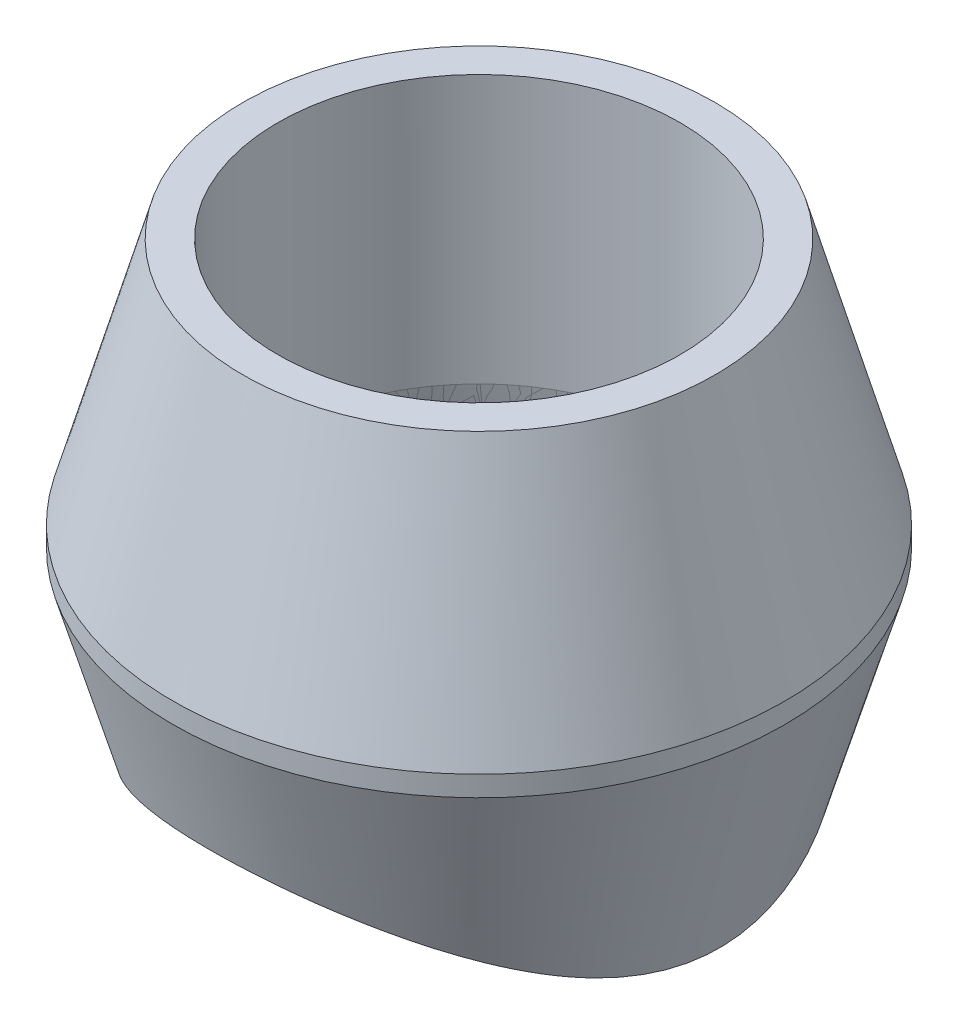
ISO-10303-21;
HEADER;
FILE_DESCRIPTION(('STEP AP214'),'2;1');
FILE_NAME('part.step','',(''),(''),'','','');
FILE_SCHEMA(('AUTOMOTIVE_DESIGN { 1 0 10303 214 1 1 1 1 }'));
ENDSEC;
DATA;
#1=APPLICATION_CONTEXT('core data for automotive mechanical design processes');
#2=APPLICATION_PROTOCOL_DEFINITION('international standard','automotive_design',2000,#1);
#3=PRODUCT_CONTEXT('',#1,'mechanical');
#4=PRODUCT('Part','Part','',(#3));
#5=PRODUCT_RELATED_PRODUCT_CATEGORY('part','',(#4));
#6=PRODUCT_DEFINITION_FORMATION('','',#4);
#7=PRODUCT_DEFINITION_CONTEXT('part definition',#1,'design');
#8=PRODUCT_DEFINITION('design','',#6,#7);
#9=PRODUCT_DEFINITION_SHAPE('','',#8);
#10=(LENGTH_UNIT() NAMED_UNIT(*) SI_UNIT(.MILLI.,.METRE.));
#11=(NAMED_UNIT(*) PLANE_ANGLE_UNIT() SI_UNIT($,.RADIAN.));
#12=(NAMED_UNIT(*) SI_UNIT($,.STERADIAN.) SOLID_ANGLE_UNIT());
#13=UNCERTAINTY_MEASURE_WITH_UNIT(LENGTH_MEASURE(1.E-05),#10,'distance_accuracy_value','');
#14=(GEOMETRIC_REPRESENTATION_CONTEXT(3) GLOBAL_UNCERTAINTY_ASSIGNED_CONTEXT((#13)) GLOBAL_UNIT_ASSIGNED_CONTEXT((#10,
#11,#12)) REPRESENTATION_CONTEXT('',''));
#15=CARTESIAN_POINT('',(0.,0.,0.));
#16=DIRECTION('',(0.,0.,1.));
#17=DIRECTION('',(1.,0.,0.));
#18=AXIS2_PLACEMENT_3D('',#15,#16,#17);
#19=CARTESIAN_POINT('',(-11.7348080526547,36.4905030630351,11.8828018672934));
#20=CARTESIAN_POINT('',(-13.1240894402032,21.746684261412,12.6905331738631));
#21=CARTESIAN_POINT('',(-12.5125356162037,36.4905030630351,11.114760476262));
#22=CARTESIAN_POINT('',(-13.9234526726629,21.2642698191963,11.8641024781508));
#23=CARTESIAN_POINT('',(-13.915402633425,36.4905030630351,9.42416521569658));
#24=CARTESIAN_POINT('',(-15.3598021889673,20.2765727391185,10.0681036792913));
#25=CARTESIAN_POINT('',(-15.4896342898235,36.4905030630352,6.53016001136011));
#26=CARTESIAN_POINT('',(-16.9945486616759,18.9066366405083,6.975396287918));
#27=CARTESIAN_POINT('',(-16.4628409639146,36.4905030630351,3.38213598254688));
#28=CARTESIAN_POINT('',(-18.0438728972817,17.8848511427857,3.50539876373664));
#29=CARTESIAN_POINT('',(-16.8094109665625,36.4905030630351,0.105250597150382));
#30=CARTESIAN_POINT('',(-18.3850462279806,17.523466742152,-0.24375295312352));
#31=CARTESIAN_POINT('',(-16.5038824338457,36.4905030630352,-3.17548663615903));
#32=CARTESIAN_POINT('',(-17.9458700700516,17.9858557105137,-3.97040194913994));
#33=CARTESIAN_POINT('',(-15.5702301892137,36.4905030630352,-6.33531523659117));
#34=CARTESIAN_POINT('',(-16.8156394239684,19.0686696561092,-7.39369530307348));
#35=CARTESIAN_POINT('',(-14.0324290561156,36.4905030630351,-9.24947472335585));
#36=CARTESIAN_POINT('',(-15.1113967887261,20.4646052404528,-10.436104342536));
#37=CARTESIAN_POINT('',(-11.9605400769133,36.4905030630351,-11.8116222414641));
#38=CARTESIAN_POINT('',(-12.8932085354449,21.9466291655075,-13.0778296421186));
#39=CARTESIAN_POINT('',(-9.42462429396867,36.4905030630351,-13.9154149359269));
#40=CARTESIAN_POINT('',(-10.1906446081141,23.3394499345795,-15.2834167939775));
#41=CARTESIAN_POINT('',(-6.53000760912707,36.4905030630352,-15.4895707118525));
#42=CARTESIAN_POINT('',(-7.03564886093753,24.4894454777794,-16.9760078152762));
#43=CARTESIAN_POINT('',(-3.38201592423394,36.4905030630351,-16.4628074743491));
#44=CARTESIAN_POINT('',(-3.50501396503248,25.247770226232,-18.0457684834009));
#45=CARTESIAN_POINT('',(-0.105309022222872,36.490503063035,-16.8094659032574));
#46=CARTESIAN_POINT('',(0.242622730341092,25.4923393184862,-18.3840087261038));
#47=CARTESIAN_POINT('',(3.17545331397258,36.4905030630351,-16.5038866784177));
#48=CARTESIAN_POINT('',(3.97443806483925,25.17713781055,-17.9474873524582));
#49=CARTESIAN_POINT('',(6.33536366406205,36.4905030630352,-15.5701693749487));
#50=CARTESIAN_POINT('',(7.46376516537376,24.3607736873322,-16.7911419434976));
#51=CARTESIAN_POINT('',(9.24951460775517,36.4905030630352,-14.0324135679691));
#52=CARTESIAN_POINT('',(10.5636600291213,23.1711038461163,-15.0270733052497));
#53=CARTESIAN_POINT('',(11.8116207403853,36.4905030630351,-11.9605832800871));
#54=CARTESIAN_POINT('',(13.2053733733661,21.7581528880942,-12.7621562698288));
#55=CARTESIAN_POINT('',(13.9153966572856,36.4905030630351,-9.42464253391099));
#56=CARTESIAN_POINT('',(15.3596844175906,20.2764961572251,-10.0676745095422));
#57=CARTESIAN_POINT('',(15.4895518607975,36.4905030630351,-6.52999159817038));
#58=CARTESIAN_POINT('',(16.9945645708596,18.9066261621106,-6.97536296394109));
#59=CARTESIAN_POINT('',(16.462795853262,36.4905030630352,-3.38203074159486));
#60=CARTESIAN_POINT('',(18.0438662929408,17.8848548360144,-3.50541195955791));
#61=CARTESIAN_POINT('',(16.8094656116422,36.4905030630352,-0.105355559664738));
#62=CARTESIAN_POINT('',(18.3850494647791,17.5234643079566,0.243760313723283));
#63=CARTESIAN_POINT('',(16.503898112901,36.4905030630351,3.17543835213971));
#64=CARTESIAN_POINT('',(17.945869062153,17.9858571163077,3.97039915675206));
#65=CARTESIAN_POINT('',(15.5701884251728,36.4905030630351,6.3353794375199));
#66=CARTESIAN_POINT('',(16.8156367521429,19.0686708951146,7.39369433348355));
#67=CARTESIAN_POINT('',(14.0324316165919,36.4905030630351,9.24949614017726));
#68=CARTESIAN_POINT('',(15.1113936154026,20.4646085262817,10.4361054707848));
#69=CARTESIAN_POINT('',(11.9605842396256,36.4905030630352,11.8115775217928));
#70=CARTESIAN_POINT('',(12.8932104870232,21.946626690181,13.0778311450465));
#71=CARTESIAN_POINT('',(9.42460284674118,36.4905030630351,13.9154126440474));
#72=CARTESIAN_POINT('',(10.1906390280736,23.339454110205,15.2834161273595));
#73=CARTESIAN_POINT('',(6.52994393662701,36.4905030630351,15.48961327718));
#74=CARTESIAN_POINT('',(7.03565051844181,24.4894424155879,16.9760050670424));
#75=CARTESIAN_POINT('',(3.38206400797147,36.4905030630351,16.4627911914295));
#76=CARTESIAN_POINT('',(3.50500808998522,25.2477755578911,18.0457773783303));
#77=CARTESIAN_POINT('',(0.105413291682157,36.4905030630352,16.8094099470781));
#78=CARTESIAN_POINT('',(-0.242617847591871,25.4923307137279,18.3839913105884));
#79=CARTESIAN_POINT('',(-3.17555798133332,36.4905030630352,16.5039331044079));
#80=CARTESIAN_POINT('',(-3.97445139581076,25.177153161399,17.9475175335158));
#81=CARTESIAN_POINT('',(-6.33553103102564,36.4905030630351,15.5702539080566));
#82=CARTESIAN_POINT('',(-7.46374374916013,24.3607448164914,16.791084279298));
#83=CARTESIAN_POINT('',(-9.24903725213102,36.4905030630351,14.0324135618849));
#84=CARTESIAN_POINT('',(-10.563622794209,23.1710593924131,15.0266878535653));
#85=CARTESIAN_POINT('',(-10.9570804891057,36.4905030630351,12.6508432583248));
#86=CARTESIAN_POINT('',(-12.3247262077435,22.2290987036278,13.5169638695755));
#87=CARTESIAN_POINT('',(-11.7348080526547,36.4905030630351,11.8828018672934));
#88=CARTESIAN_POINT('',(-13.1240894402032,21.746684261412,12.6905331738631));
#89=B_SPLINE_SURFACE_WITH_KNOTS('',3,1,((#19,#20),(#21,#22),(#23,#24),(#25,#26),(#27,#28),(#29,
#30),(#31,#32),(#33,#34),(#35,#36),(#37,#38),(#39,#40),(#41,#42),(#43,#44),(#45,#46),(#47,#48),
(#49,#50),(#51,#52),(#53,#54),(#55,#56),(#57,#58),(#59,#60),(#61,#62),(#63,#64),(#65,#66),(#67,
#68),(#69,#70),(#71,#72),(#73,#74),(#75,#76),(#77,#78),(#79,#80),(#81,#82),(#83,#84),(#85,#86),
(#87,#88)),.UNSPECIFIED.,.T.,.F.,.F.,(4,1,1,1,1,1,1,1,1,1,1,1,1,1,1,1,1,1,1,1,1,1,1,1,1,1,1,1,1,
1,1,1,4),(2,2),(0.,0.03125,0.0625,0.09375,0.125,0.15625,0.1875,0.21875,0.25,0.28125,0.3125,
0.34375,0.375,0.40625,0.4375,0.46875,0.5,0.53125,0.5625,0.59375,0.625,0.65625,0.6875,0.71875,
0.75,0.78125,0.8125,0.84375,0.875,0.90625,0.9375,0.96875,1.),(0.,1.),.UNSPECIFIED.);
#90=CARTESIAN_POINT('',(0.,36.4905030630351,0.));
#91=DIRECTION('',(0.,1.,0.));
#92=DIRECTION('',(0.,0.,1.));
#93=AXIS2_PLACEMENT_3D('',#90,#91,#92);
#94=CIRCLE('',#93,16.7005);
#95=CARTESIAN_POINT('',(0.,36.4905030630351,16.7005));
#96=VERTEX_POINT('',#95);
#97=EDGE_CURVE('E12',#96,#96,#94,.F.);
#98=CARTESIAN_POINT('',(-13.1240894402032,21.746684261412,12.6905331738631));
#99=CARTESIAN_POINT('',(-13.9234526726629,21.2642698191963,11.8641024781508));
#100=CARTESIAN_POINT('',(-15.3598021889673,20.2765727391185,10.0681036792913));
#101=CARTESIAN_POINT('',(-16.9945486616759,18.9066366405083,6.975396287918));
#102=CARTESIAN_POINT('',(-18.0438728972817,17.8848511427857,3.50539876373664));
#103=CARTESIAN_POINT('',(-18.3850462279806,17.523466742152,-0.24375295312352));
#104=CARTESIAN_POINT('',(-17.9458700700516,17.9858557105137,-3.97040194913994));
#105=CARTESIAN_POINT('',(-16.8156394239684,19.0686696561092,-7.39369530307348));
#106=CARTESIAN_POINT('',(-15.1113967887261,20.4646052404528,-10.436104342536));
#107=CARTESIAN_POINT('',(-12.8932085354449,21.9466291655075,-13.0778296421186));
#108=CARTESIAN_POINT('',(-10.1906446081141,23.3394499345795,-15.2834167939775));
#109=CARTESIAN_POINT('',(-7.03564886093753,24.4894454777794,-16.9760078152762));
#110=CARTESIAN_POINT('',(-3.50501396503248,25.247770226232,-18.0457684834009));
#111=CARTESIAN_POINT('',(0.242622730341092,25.4923393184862,-18.3840087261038));
#112=CARTESIAN_POINT('',(3.97443806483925,25.17713781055,-17.9474873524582));
#113=CARTESIAN_POINT('',(7.46376516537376,24.3607736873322,-16.7911419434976));
#114=CARTESIAN_POINT('',(10.5636600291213,23.1711038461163,-15.0270733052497));
#115=CARTESIAN_POINT('',(13.2053733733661,21.7581528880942,-12.7621562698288));
#116=CARTESIAN_POINT('',(15.3596844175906,20.2764961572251,-10.0676745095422));
#117=CARTESIAN_POINT('',(16.9945645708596,18.9066261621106,-6.97536296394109));
#118=CARTESIAN_POINT('',(18.0438662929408,17.8848548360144,-3.50541195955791));
#119=CARTESIAN_POINT('',(18.3850494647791,17.5234643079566,0.243760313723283));
#120=CARTESIAN_POINT('',(17.945869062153,17.9858571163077,3.97039915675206));
#121=CARTESIAN_POINT('',(16.8156367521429,19.0686708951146,7.39369433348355));
#122=CARTESIAN_POINT('',(15.1113936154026,20.4646085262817,10.4361054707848));
#123=CARTESIAN_POINT('',(12.8932104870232,21.946626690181,13.0778311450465));
#124=CARTESIAN_POINT('',(10.1906390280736,23.339454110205,15.2834161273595));
#125=CARTESIAN_POINT('',(7.03565051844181,24.4894424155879,16.9760050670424));
#126=CARTESIAN_POINT('',(3.50500808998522,25.2477755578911,18.0457773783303));
#127=CARTESIAN_POINT('',(-0.242617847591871,25.4923307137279,18.3839913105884));
#128=CARTESIAN_POINT('',(-3.97445139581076,25.177153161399,17.9475175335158));
#129=CARTESIAN_POINT('',(-7.46374374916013,24.3607448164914,16.791084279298));
#130=CARTESIAN_POINT('',(-10.563622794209,23.1710593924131,15.0266878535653));
#131=CARTESIAN_POINT('',(-12.3247262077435,22.2290987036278,13.5169638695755));
#132=CARTESIAN_POINT('',(-13.1240894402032,21.746684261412,12.6905331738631));
#133=B_SPLINE_CURVE_WITH_KNOTS('',3,(#98,#99,#100,#101,#102,#103,#104,#105,#106,#107,#108,#109,
#110,#111,#112,#113,#114,#115,#116,#117,#118,#119,#120,#121,#122,#123,#124,#125,#126,#127,#128,
#129,#130,#131,#132),.UNSPECIFIED.,.T.,.F.,(4,1,1,1,1,1,1,1,1,1,1,1,1,1,1,1,1,1,1,1,1,1,1,1,1,1,
1,1,1,1,1,1,4),(0.,0.03125,0.0625,0.09375,0.125,0.15625,0.1875,0.21875,0.25,0.28125,0.3125,
0.34375,0.375,0.40625,0.4375,0.46875,0.5,0.53125,0.5625,0.59375,0.625,0.65625,0.6875,0.71875,
0.75,0.78125,0.8125,0.84375,0.875,0.90625,0.9375,0.96875,1.),.UNSPECIFIED.);
#134=CARTESIAN_POINT('',(-13.1240894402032,21.746684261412,12.6905331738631));
#135=VERTEX_POINT('',#134);
#136=EDGE_CURVE('E83',#135,#135,#133,.T.);
#137=ORIENTED_EDGE('',*,*,#97,.T.);
#138=EDGE_LOOP('',(#137));
#139=FACE_BOUND('',#138,.T.);
#140=ORIENTED_EDGE('',*,*,#136,.F.);
#141=EDGE_LOOP('',(#140));
#142=FACE_BOUND('',#141,.T.);
#143=ADVANCED_FACE('F73',(#139,#142),#89,.T.);
#144=OPEN_SHELL('',(#143));
#145=SHELL_BASED_SURFACE_MODEL('B2',(#144));
#146=CARTESIAN_POINT('',(0.,0.,-25.4));
#147=DIRECTION('',(0.,0.,1.));
#148=DIRECTION('',(1.,0.,0.));
#149=AXIS2_PLACEMENT_3D('',#146,#147,#148);
#150=CYLINDRICAL_SURFACE('',#149,25.4);
#151=CARTESIAN_POINT('',(-13.6463689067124,21.4228059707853,-14.6199220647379));
#152=CARTESIAN_POINT('',(-14.4414014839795,20.9163574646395,-13.6197711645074));
#153=CARTESIAN_POINT('',(-15.1325955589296,20.4143309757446,-12.5573071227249));
#154=CARTESIAN_POINT('',(-16.3345640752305,19.4662139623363,-10.3050058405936));
#155=CARTESIAN_POINT('',(-16.8489756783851,19.0157004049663,-9.10200327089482));
#156=CARTESIAN_POINT('',(-17.6793086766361,18.2460437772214,-6.58493198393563));
#157=CARTESIAN_POINT('',(-17.9909172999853,17.9327075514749,-5.29147262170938));
#158=CARTESIAN_POINT('',(-18.4124859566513,17.4993715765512,-2.59629706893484));
#159=CARTESIAN_POINT('',(-18.5150436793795,17.3884298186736,-1.19971253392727));
#160=CARTESIAN_POINT('',(-18.4967235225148,17.4076775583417,1.54244534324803));
#161=CARTESIAN_POINT('',(-18.3785086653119,17.535488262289,2.9133291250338));
#162=CARTESIAN_POINT('',(-17.9199237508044,18.0041206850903,5.61948443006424));
#163=CARTESIAN_POINT('',(-17.5899166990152,18.3326278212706,6.90945342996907));
#164=CARTESIAN_POINT('',(-16.7275111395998,19.1234016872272,9.40181252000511));
#165=CARTESIAN_POINT('',(-16.1958592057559,19.5824214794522,10.600431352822));
#166=CARTESIAN_POINT('',(-14.9611299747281,20.5409136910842,12.8331180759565));
#167=CARTESIAN_POINT('',(-14.252047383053,21.0467752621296,13.8873104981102));
#168=CARTESIAN_POINT('',(-11.8247379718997,22.5595642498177,16.8403007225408));
#169=CARTESIAN_POINT('',(-9.88193146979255,23.5193855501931,18.4576215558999));
#170=CARTESIAN_POINT('',(-5.23624198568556,24.9788704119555,20.8443598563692));
#171=CARTESIAN_POINT('',(-2.57528632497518,25.4123982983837,21.5053946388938));
#172=CARTESIAN_POINT('',(2.79593106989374,25.3871225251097,21.4660234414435));
#173=CARTESIAN_POINT('',(5.46461685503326,24.9248547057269,20.7587393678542));
#174=CARTESIAN_POINT('',(10.068973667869,23.441947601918,18.3279549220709));
#175=CARTESIAN_POINT('',(12.037701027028,22.4445965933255,16.6344051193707));
#176=CARTESIAN_POINT('',(14.402435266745,20.9426062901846,13.6732402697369));
#177=CARTESIAN_POINT('',(15.1111070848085,20.4307293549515,12.5943021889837));
#178=CARTESIAN_POINT('',(16.321555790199,19.4770105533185,10.3325553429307));
#179=CARTESIAN_POINT('',(16.8307313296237,19.03167882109,9.14461450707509));
#180=CARTESIAN_POINT('',(17.6614696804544,18.2634692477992,6.65122366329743));
#181=CARTESIAN_POINT('',(17.9860493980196,17.9376674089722,5.31850356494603));
#182=CARTESIAN_POINT('',(18.4082172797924,17.5037963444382,2.62758103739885));
#183=CARTESIAN_POINT('',(18.5140645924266,17.3893451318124,1.25248205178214));
#184=CARTESIAN_POINT('',(18.4979939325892,17.4064523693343,-1.54817693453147));
#185=CARTESIAN_POINT('',(18.377017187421,17.5369278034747,-2.91637179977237));
#186=CARTESIAN_POINT('',(17.9241340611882,17.9999040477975,-5.60037755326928));
#187=CARTESIAN_POINT('',(17.5852420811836,18.3374103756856,-6.9243990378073));
#188=CARTESIAN_POINT('',(16.726438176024,19.1238842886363,-9.40349123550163));
#189=CARTESIAN_POINT('',(16.2040019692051,19.5757282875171,-10.584022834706));
#190=CARTESIAN_POINT('',(14.9582802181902,20.543496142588,-12.8399466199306));
#191=CARTESIAN_POINT('',(14.2389386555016,21.0544117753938,-13.90247733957));
#192=CARTESIAN_POINT('',(11.8428290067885,22.5493595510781,-16.8198563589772));
#193=CARTESIAN_POINT('',(9.84446014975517,23.5400176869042,-18.4928050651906));
#194=CARTESIAN_POINT('',(6.36238063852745,24.6204783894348,-20.257539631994));
#195=CARTESIAN_POINT('',(5.10061349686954,24.9169880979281,-20.72798118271));
#196=CARTESIAN_POINT('',(2.53482426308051,25.3059159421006,-21.3404204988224));
#197=CARTESIAN_POINT('',(1.19738795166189,25.407288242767,-21.4973415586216));
#198=CARTESIAN_POINT('',(-2.86602102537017,25.3839663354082,-21.4612940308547));
#199=CARTESIAN_POINT('',(-5.50101994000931,24.9178766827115,-20.7488823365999));
#200=CARTESIAN_POINT('',(-8.96201013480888,23.7960871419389,-18.9076376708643));
#201=CARTESIAN_POINT('',(-10.0374251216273,23.3575544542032,-18.1716577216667));
#202=CARTESIAN_POINT('',(-11.9716236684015,22.4271784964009,-16.5323356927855));
#203=CARTESIAN_POINT('',(-12.8513363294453,21.9292544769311,-15.6200729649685));
#204=CARTESIAN_POINT('',(-13.6463689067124,21.4228059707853,-14.6199220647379));
#205=B_SPLINE_CURVE_WITH_KNOTS('',3,(#151,#152,#153,#154,#155,#156,#157,#158,#159,#160,#161,
#162,#163,#164,#165,#166,#167,#168,#169,#170,#171,#172,#173,#174,#175,#176,#177,#178,#179,#180,
#181,#182,#183,#184,#185,#186,#187,#188,#189,#190,#191,#192,#193,#194,#195,#196,#197,#198,#199,
#200,#201,#202,#203,#204),.UNSPECIFIED.,.T.,.F.,(4,2,2,2,2,2,2,2,2,2,2,2,2,2,2,2,2,2,2,2,2,2,2,
2,2,2,4),(0.131997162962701,0.136127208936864,0.140257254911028,0.144387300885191,
0.148517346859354,0.152647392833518,0.156777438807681,0.160907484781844,0.165037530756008,
0.173297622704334,0.181557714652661,0.189817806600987,0.198077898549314,0.202207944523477,
0.206337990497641,0.210468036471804,0.214598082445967,0.218728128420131,0.222858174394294,
0.226988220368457,0.231118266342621,0.239378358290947,0.24350840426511,0.247638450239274,
0.2558985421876,0.260028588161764,0.264158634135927),.UNSPECIFIED.);
#206=CARTESIAN_POINT('',(-13.6463689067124,21.4228059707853,-14.6199220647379));
#207=VERTEX_POINT('',#206);
#208=EDGE_CURVE('E139',#207,#207,#205,.F.);
#209=ORIENTED_EDGE('',*,*,#208,.T.);
#210=EDGE_LOOP('',(#209));
#211=FACE_BOUND('',#210,.T.);
#212=CARTESIAN_POINT('',(-13.1240894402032,21.7466842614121,12.6905331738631));
#213=CARTESIAN_POINT('',(-13.9234526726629,21.2642698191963,11.8641024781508));
#214=CARTESIAN_POINT('',(-15.3598021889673,20.2765727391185,10.0681036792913));
#215=CARTESIAN_POINT('',(-16.9945486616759,18.9066366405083,6.975396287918));
#216=CARTESIAN_POINT('',(-18.0438728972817,17.8848511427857,3.50539876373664));
#217=CARTESIAN_POINT('',(-18.3850462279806,17.523466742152,-0.24375295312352));
#218=CARTESIAN_POINT('',(-17.9458700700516,17.9858557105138,-3.97040194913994));
#219=CARTESIAN_POINT('',(-16.8156394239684,19.0686696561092,-7.39369530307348));
#220=CARTESIAN_POINT('',(-15.1113967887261,20.4646052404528,-10.436104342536));
#221=CARTESIAN_POINT('',(-12.8932085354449,21.9466291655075,-13.0778296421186));
#222=CARTESIAN_POINT('',(-10.1906446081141,23.3394499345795,-15.2834167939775));
#223=CARTESIAN_POINT('',(-7.03564886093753,24.4894454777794,-16.9760078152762));
#224=CARTESIAN_POINT('',(-3.50501396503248,25.247770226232,-18.0457684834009));
#225=CARTESIAN_POINT('',(0.242622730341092,25.4923393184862,-18.3840087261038));
#226=CARTESIAN_POINT('',(3.97443806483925,25.17713781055,-17.9474873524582));
#227=CARTESIAN_POINT('',(7.46376516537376,24.3607736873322,-16.7911419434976));
#228=CARTESIAN_POINT('',(10.5636600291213,23.1711038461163,-15.0270733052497));
#229=CARTESIAN_POINT('',(13.2053733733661,21.7581528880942,-12.7621562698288));
#230=CARTESIAN_POINT('',(15.3596844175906,20.2764961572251,-10.0676745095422));
#231=CARTESIAN_POINT('',(16.9945645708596,18.9066261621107,-6.97536296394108));
#232=CARTESIAN_POINT('',(18.0438662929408,17.8848548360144,-3.50541195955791));
#233=CARTESIAN_POINT('',(18.3850494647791,17.5234643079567,0.243760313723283));
#234=CARTESIAN_POINT('',(17.945869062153,17.9858571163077,3.97039915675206));
#235=CARTESIAN_POINT('',(16.8156367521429,19.0686708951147,7.39369433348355));
#236=CARTESIAN_POINT('',(15.1113936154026,20.4646085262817,10.4361054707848));
#237=CARTESIAN_POINT('',(12.8932104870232,21.946626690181,13.0778311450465));
#238=CARTESIAN_POINT('',(10.1906390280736,23.339454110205,15.2834161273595));
#239=CARTESIAN_POINT('',(7.03565051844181,24.489442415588,16.9760050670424));
#240=CARTESIAN_POINT('',(3.50500808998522,25.2477755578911,18.0457773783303));
#241=CARTESIAN_POINT('',(-0.242617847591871,25.4923307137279,18.3839913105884));
#242=CARTESIAN_POINT('',(-3.97445139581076,25.177153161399,17.9475175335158));
#243=CARTESIAN_POINT('',(-7.46374374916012,24.3607448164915,16.791084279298));
#244=CARTESIAN_POINT('',(-10.563622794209,23.1710593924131,15.0266878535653));
#245=CARTESIAN_POINT('',(-12.3247262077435,22.2290987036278,13.5169638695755));
#246=CARTESIAN_POINT('',(-13.1240894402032,21.7466842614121,12.6905331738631));
#247=B_SPLINE_CURVE_WITH_KNOTS('',3,(#212,#213,#214,#215,#216,#217,#218,#219,#220,#221,#222,
#223,#224,#225,#226,#227,#228,#229,#230,#231,#232,#233,#234,#235,#236,#237,#238,#239,#240,#241,
#242,#243,#244,#245,#246),.UNSPECIFIED.,.T.,.F.,(4,1,1,1,1,1,1,1,1,1,1,1,1,1,1,1,1,1,1,1,1,1,1,
1,1,1,1,1,1,1,1,1,4),(0.,0.03125,0.0625,0.09375,0.125,0.15625,0.1875,0.21875,0.25,0.28125,
0.3125,0.34375,0.375,0.40625,0.4375,0.46875,0.5,0.53125,0.5625,0.59375,0.625,0.65625,0.6875,
0.71875,0.75,0.78125,0.8125,0.84375,0.875,0.90625,0.9375,0.96875,1.),.UNSPECIFIED.);
#248=CARTESIAN_POINT('',(-13.1240894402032,21.7466842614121,12.6905331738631));
#249=VERTEX_POINT('',#248);
#250=EDGE_CURVE('E216',#249,#249,#247,.T.);
#251=ORIENTED_EDGE('',*,*,#250,.F.);
#252=EDGE_LOOP('',(#251));
#253=FACE_BOUND('',#252,.T.);
#254=ADVANCED_FACE('F199',(#211,#253),#150,.F.);
#255=CARTESIAN_POINT('',(0.,0.,0.));
#256=DIRECTION('',(0.,-1.,0.));
#257=DIRECTION('',(0.,0.,-1.));
#258=AXIS2_PLACEMENT_3D('',#255,#256,#257);
#259=CYLINDRICAL_SURFACE('',#258,16.7005);
#260=CARTESIAN_POINT('',(0.,36.4905030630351,0.));
#261=DIRECTION('',(0.,1.,0.));
#262=DIRECTION('',(0.,0.,1.));
#263=AXIS2_PLACEMENT_3D('',#260,#261,#262);
#264=CIRCLE('',#263,16.7005);
#265=CARTESIAN_POINT('',(0.,36.4905030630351,16.7005));
#266=VERTEX_POINT('',#265);
#267=EDGE_CURVE('E295',#266,#266,#264,.F.);
#268=ORIENTED_EDGE('',*,*,#267,.T.);
#269=EDGE_LOOP('',(#268));
#270=FACE_BOUND('',#269,.T.);
#271=CARTESIAN_POINT('',(0.,58.7375,0.));
#272=DIRECTION('',(0.,-1.,0.));
#273=DIRECTION('',(0.,0.,-1.));
#274=AXIS2_PLACEMENT_3D('',#271,#272,#273);
#275=CIRCLE('',#274,16.7005);
#276=CARTESIAN_POINT('',(0.,58.7375,-16.7005));
#277=VERTEX_POINT('',#276);
#278=EDGE_CURVE('E222',#277,#277,#275,.T.);
#279=ORIENTED_EDGE('',*,*,#278,.F.);
#280=EDGE_LOOP('',(#279));
#281=FACE_BOUND('',#280,.T.);
#282=ADVANCED_FACE('F256',(#270,#281),#259,.F.);
#283=CARTESIAN_POINT('',(-4.55878848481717,58.7375,0.));
#284=DIRECTION('',(0.,1.,0.));
#285=DIRECTION('',(0.,0.,1.));
#286=AXIS2_PLACEMENT_3D('',#283,#284,#285);
#287=PLANE('',#286);
#288=ORIENTED_EDGE('',*,*,#278,.T.);
#289=EDGE_LOOP('',(#288));
#290=FACE_BOUND('',#289,.T.);
#291=CARTESIAN_POINT('',(0.,58.7375,0.));
#292=DIRECTION('',(0.,-1.,0.));
#293=DIRECTION('',(0.,0.,-1.));
#294=AXIS2_PLACEMENT_3D('',#291,#292,#293);
#295=CIRCLE('',#294,19.6023470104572);
#296=CARTESIAN_POINT('',(0.,58.7375,-19.6023470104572));
#297=VERTEX_POINT('',#296);
#298=EDGE_CURVE('E230',#297,#297,#295,.T.);
#299=ORIENTED_EDGE('',*,*,#298,.F.);
#300=EDGE_LOOP('',(#299));
#301=FACE_BOUND('',#300,.T.);
#302=ADVANCED_FACE('F328',(#290,#301),#287,.T.);
#303=CARTESIAN_POINT('',(0.,58.7375,0.));
#304=DIRECTION('',(0.,-1.,0.));
#305=DIRECTION('',(0.,0.,-1.));
#306=AXIS2_PLACEMENT_3D('',#303,#304,#305);
#307=CONICAL_SURFACE('',#306,19.6023470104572,0.274877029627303);
#308=CARTESIAN_POINT('',(0.,38.1796030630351,0.));
#309=DIRECTION('',(0.,-1.,0.));
#310=DIRECTION('',(0.,0.,-1.));
#311=AXIS2_PLACEMENT_3D('',#308,#309,#310);
#312=CIRCLE('',#311,25.4);
#313=CARTESIAN_POINT('',(0.,38.1796030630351,-25.4));
#314=VERTEX_POINT('',#313);
#315=EDGE_CURVE('E235',#314,#314,#312,.T.);
#316=ORIENTED_EDGE('',*,*,#315,.F.);
#317=EDGE_LOOP('',(#316));
#318=FACE_BOUND('',#317,.T.);
#319=ORIENTED_EDGE('',*,*,#298,.T.);
#320=EDGE_LOOP('',(#319));
#321=FACE_BOUND('',#320,.T.);
#322=ADVANCED_FACE('F331',(#318,#321),#307,.T.);
#323=CARTESIAN_POINT('',(0.,0.,0.));
#324=DIRECTION('',(0.,-1.,0.));
#325=DIRECTION('',(0.,0.,-1.));
#326=AXIS2_PLACEMENT_3D('',#323,#324,#325);
#327=CYLINDRICAL_SURFACE('',#326,25.4);
#328=CARTESIAN_POINT('',(0.,36.4905030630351,0.));
#329=DIRECTION('',(0.,-1.,0.));
#330=DIRECTION('',(0.,0.,-1.));
#331=AXIS2_PLACEMENT_3D('',#328,#329,#330);
#332=CIRCLE('',#331,25.4);
#333=CARTESIAN_POINT('',(0.,36.4905030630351,-25.4));
#334=VERTEX_POINT('',#333);
#335=EDGE_CURVE('E298',#334,#334,#332,.T.);
#336=ORIENTED_EDGE('',*,*,#335,.F.);
#337=EDGE_LOOP('',(#336));
#338=FACE_BOUND('',#337,.T.);
#339=ORIENTED_EDGE('',*,*,#315,.T.);
#340=EDGE_LOOP('',(#339));
#341=FACE_BOUND('',#340,.T.);
#342=ADVANCED_FACE('F293',(#338,#341),#327,.T.);
#343=CARTESIAN_POINT('',(0.,36.4905030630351,0.));
#344=DIRECTION('',(0.,1.,0.));
#345=DIRECTION('',(0.,0.,1.));
#346=AXIS2_PLACEMENT_3D('',#343,#344,#345);
#347=CONICAL_SURFACE('',#346,25.4,0.281951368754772);
#348=CARTESIAN_POINT('',(-14.6783137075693,21.8534592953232,-15.2413090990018));
#349=CARTESIAN_POINT('',(-14.414701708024,22.0137142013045,-15.5596893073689));
#350=CARTESIAN_POINT('',(-14.1416143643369,22.1737268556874,-15.8704759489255));
#351=CARTESIAN_POINT('',(-13.5781275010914,22.4906148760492,-16.474217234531));
#352=CARTESIAN_POINT('',(-13.2878232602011,22.6475020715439,-16.7672546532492));
#353=CARTESIAN_POINT('',(-12.8389758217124,22.8795454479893,-17.1935397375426));
#354=CARTESIAN_POINT('',(-12.6873308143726,22.956249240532,-17.3332525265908));
#355=CARTESIAN_POINT('',(-12.3796638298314,23.1083301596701,-17.6081410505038));
#356=CARTESIAN_POINT('',(-12.2236467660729,23.183708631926,-17.7433215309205));
#357=CARTESIAN_POINT('',(-11.907145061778,23.3330067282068,-18.0092174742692));
#358=CARTESIAN_POINT('',(-11.7466600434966,23.406926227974,-18.1399325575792));
#359=CARTESIAN_POINT('',(-11.4204506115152,23.5532667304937,-18.3969856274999));
#360=CARTESIAN_POINT('',(-11.2547087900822,23.6256810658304,-18.5233053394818));
#361=CARTESIAN_POINT('',(-10.9181469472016,23.7687915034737,-18.7714013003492));
#362=CARTESIAN_POINT('',(-10.7473113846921,23.8394808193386,-18.8931603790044));
#363=CARTESIAN_POINT('',(-10.4007824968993,23.9788504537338,-19.1318351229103));
#364=CARTESIAN_POINT('',(-10.2250780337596,24.047525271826,-19.2487378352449));
#365=CARTESIAN_POINT('',(-9.86904793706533,24.1825837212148,-19.4774147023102));
#366=CARTESIAN_POINT('',(-9.68871517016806,24.2489633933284,-19.5891800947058));
#367=CARTESIAN_POINT('',(-9.32364865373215,24.3791323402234,-19.807277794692));
#368=CARTESIAN_POINT('',(-9.13891129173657,24.4429193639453,-19.9136054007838));
#369=CARTESIAN_POINT('',(-8.7653077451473,24.5676620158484,-20.1205861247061));
#370=CARTESIAN_POINT('',(-8.57644100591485,24.6286172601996,-20.2212384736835));
#371=CARTESIAN_POINT('',(-8.1946717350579,24.7472353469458,-20.4163897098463));
#372=CARTESIAN_POINT('',(-8.00177144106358,24.8048999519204,-20.510891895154));
#373=CARTESIAN_POINT('',(-7.61207304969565,24.9165913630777,-20.6933724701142));
#374=CARTESIAN_POINT('',(-7.41527817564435,24.9706210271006,-20.7813559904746));
#375=CARTESIAN_POINT('',(-7.01807328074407,25.0749300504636,-20.9506882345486));
#376=CARTESIAN_POINT('',(-6.81766627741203,25.1252123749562,-21.0320422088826));
#377=CARTESIAN_POINT('',(-6.41347099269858,25.2218557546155,-21.1879414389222));
#378=CARTESIAN_POINT('',(-6.20968538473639,25.2682197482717,-21.2624918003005));
#379=CARTESIAN_POINT('',(-5.79898003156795,25.3568713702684,-21.404627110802));
#380=CARTESIAN_POINT('',(-5.59206244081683,25.3991616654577,-21.4722166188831));
#381=CARTESIAN_POINT('',(-5.17533691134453,25.4795068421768,-21.6002694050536));
#382=CARTESIAN_POINT('',(-4.96553047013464,25.5175638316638,-21.6607362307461));
#383=CARTESIAN_POINT('',(-4.54327209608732,25.5892847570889,-21.7743845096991));
#384=CARTESIAN_POINT('',(-4.33082090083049,25.6229498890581,-21.8275679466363));
#385=CARTESIAN_POINT('',(-3.90351771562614,25.6857295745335,-21.9264905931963));
#386=CARTESIAN_POINT('',(-3.68866565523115,25.7148439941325,-21.9722295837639));
#387=CARTESIAN_POINT('',(-3.25680552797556,25.7683650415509,-22.0561050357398));
#388=CARTESIAN_POINT('',(-3.03979660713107,25.7927697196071,-22.0942383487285));
#389=CARTESIAN_POINT('',(-2.60386752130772,25.8367152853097,-22.1627455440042));
#390=CARTESIAN_POINT('',(-2.38494583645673,25.8562518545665,-22.1931125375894));
#391=CARTESIAN_POINT('',(-1.94543572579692,25.8903030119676,-22.2459284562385));
#392=CARTESIAN_POINT('',(-1.72484534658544,25.9048102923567,-22.2683658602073));
#393=CARTESIAN_POINT('',(-1.28224256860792,25.9286556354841,-22.3051744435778));
#394=CARTESIAN_POINT('',(-1.06022815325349,25.937982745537,-22.3195285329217));
#395=CARTESIAN_POINT('',(-0.615019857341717,25.9512825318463,-22.3399874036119));
#396=CARTESIAN_POINT('',(-0.391824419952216,25.9552397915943,-22.3460684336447));
#397=CARTESIAN_POINT('',(0.0545902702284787,25.9577551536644,-22.3499257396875));
#398=CARTESIAN_POINT('',(0.277809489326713,25.9563150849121,-22.3477048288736));
#399=CARTESIAN_POINT('',(0.723092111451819,25.9482274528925,-22.3351435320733));
#400=CARTESIAN_POINT('',(0.945156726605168,25.9415992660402,-22.3248333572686));
#401=CARTESIAN_POINT('',(1.38784031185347,25.9232287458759,-22.2962166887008));
#402=CARTESIAN_POINT('',(1.60846163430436,25.9115029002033,-22.2779359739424));
#403=CARTESIAN_POINT('',(2.04796866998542,25.8830688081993,-22.2335365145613));
#404=CARTESIAN_POINT('',(2.26685750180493,25.8663744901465,-22.2074396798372));
#405=CARTESIAN_POINT('',(2.70261049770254,25.8281240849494,-22.1475565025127));
#406=CARTESIAN_POINT('',(2.91947827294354,25.8065798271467,-22.1137888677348));
#407=CARTESIAN_POINT('',(3.35089870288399,25.7587536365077,-22.0387125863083));
#408=CARTESIAN_POINT('',(3.56545528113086,25.7324818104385,-21.997420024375));
#409=CARTESIAN_POINT('',(3.99218744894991,25.6752899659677,-21.9074022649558));
#410=CARTESIAN_POINT('',(4.20436490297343,25.6443739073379,-21.8586833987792));
#411=CARTESIAN_POINT('',(4.62712904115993,25.5777272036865,-21.7534259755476));
#412=CARTESIAN_POINT('',(4.83770293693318,25.5419738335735,-21.6968504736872));
#413=CARTESIAN_POINT('',(5.25689141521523,25.4659507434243,-21.5762409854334));
#414=CARTESIAN_POINT('',(5.46549353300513,25.425662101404,-21.5121757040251));
#415=CARTESIAN_POINT('',(5.88010870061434,25.3408365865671,-21.3769011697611));
#416=CARTESIAN_POINT('',(6.08611367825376,25.296289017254,-21.3056739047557));
#417=CARTESIAN_POINT('',(6.49490820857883,25.203228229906,-21.15641178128));
#418=CARTESIAN_POINT('',(6.69769531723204,25.1547121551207,-21.0783720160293));
#419=CARTESIAN_POINT('',(7.0994300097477,25.053998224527,-20.9158233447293));
#420=CARTESIAN_POINT('',(7.29838193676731,25.0018048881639,-20.8313223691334));
#421=CARTESIAN_POINT('',(7.69180206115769,24.8940030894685,-20.6561606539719));
#422=CARTESIAN_POINT('',(7.88628259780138,24.8384061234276,-20.5655205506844));
#423=CARTESIAN_POINT('',(8.27073321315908,24.723970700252,-20.3782383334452));
#424=CARTESIAN_POINT('',(8.4607130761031,24.6651404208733,-20.2816112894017));
#425=CARTESIAN_POINT('',(8.83655502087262,24.5444387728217,-20.0824885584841));
#426=CARTESIAN_POINT('',(9.02241754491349,24.4825677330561,-19.979993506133));
#427=CARTESIAN_POINT('',(9.38993270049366,24.3560191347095,-19.7693200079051));
#428=CARTESIAN_POINT('',(9.57158506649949,24.291341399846,-19.6611412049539));
#429=CARTESIAN_POINT('',(9.93060746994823,24.159431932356,-19.4393151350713));
#430=CARTESIAN_POINT('',(10.1079769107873,24.0921998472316,-19.3256671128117));
#431=CARTESIAN_POINT('',(10.4583552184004,23.9554289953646,-19.0931088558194));
#432=CARTESIAN_POINT('',(10.6313635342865,23.8858899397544,-18.9741979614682));
#433=CARTESIAN_POINT('',(10.972942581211,23.7447535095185,-18.7313218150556));
#434=CARTESIAN_POINT('',(11.1415131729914,23.6731560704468,-18.6073564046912));
#435=CARTESIAN_POINT('',(11.4741383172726,23.5281509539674,-18.3545785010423));
#436=CARTESIAN_POINT('',(11.638193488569,23.4547435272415,-18.2257666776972));
#437=CARTESIAN_POINT('',(11.96171164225,23.3063657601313,-17.9635016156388));
#438=CARTESIAN_POINT('',(12.1211763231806,23.2313960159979,-17.8300501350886));
#439=CARTESIAN_POINT('',(12.4354274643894,23.0801438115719,-17.55871656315));
#440=CARTESIAN_POINT('',(12.5902170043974,23.0038622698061,-17.4208375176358));
#441=CARTESIAN_POINT('',(13.047164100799,22.773572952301,-17.0011413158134));
#442=CARTESIAN_POINT('',(13.3424970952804,22.6178451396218,-16.7127801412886));
#443=CARTESIAN_POINT('',(13.9134278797,22.3040956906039,-16.1207776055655));
#444=CARTESIAN_POINT('',(14.1890959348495,22.1460849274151,-15.8171980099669));
#445=CARTESIAN_POINT('',(14.7222153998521,21.8287070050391,-15.1942724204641));
#446=CARTESIAN_POINT('',(14.9796404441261,21.6693382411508,-14.874904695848));
#447=CARTESIAN_POINT('',(15.4776019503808,21.350543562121,-14.2198684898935));
#448=CARTESIAN_POINT('',(15.7180295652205,21.1911228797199,-13.8841147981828));
#449=CARTESIAN_POINT('',(16.1807627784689,20.8745672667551,-13.1976654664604));
#450=CARTESIAN_POINT('',(16.4030134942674,20.7174403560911,-12.8469291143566));
#451=CARTESIAN_POINT('',(16.8280176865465,20.4080655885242,-12.1324774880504));
#452=CARTESIAN_POINT('',(17.0307968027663,20.2558114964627,-11.7687801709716));
#453=CARTESIAN_POINT('',(17.4162868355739,19.958754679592,-11.0303560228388));
#454=CARTESIAN_POINT('',(17.599085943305,19.8139208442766,-10.6556877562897));
#455=CARTESIAN_POINT('',(17.9449136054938,19.5333492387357,-9.89491800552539));
#456=CARTESIAN_POINT('',(18.1079783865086,19.3975950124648,-9.50883914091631));
#457=CARTESIAN_POINT('',(18.338092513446,19.2020056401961,-8.92128779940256));
#458=CARTESIAN_POINT('',(18.4124056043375,19.1381296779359,-8.72396505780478));
#459=CARTESIAN_POINT('',(18.5563194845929,19.013189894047,-8.32580080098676));
#460=CARTESIAN_POINT('',(18.6259014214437,18.9521376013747,-8.12494881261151));
#461=CARTESIAN_POINT('',(18.7602544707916,18.8331400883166,-7.7195098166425));
#462=CARTESIAN_POINT('',(18.8249993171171,18.775212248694,-7.51490900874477));
#463=CARTESIAN_POINT('',(18.9495352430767,18.6628104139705,-7.10249879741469));
#464=CARTESIAN_POINT('',(19.0093097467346,18.608348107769,-6.89468120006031));
#465=CARTESIAN_POINT('',(19.1237037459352,18.5032700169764,-6.47633285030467));
#466=CARTESIAN_POINT('',(19.1783158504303,18.4526597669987,-6.2657986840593));
#467=CARTESIAN_POINT('',(19.2821965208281,18.355670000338,-5.84252096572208));
#468=CARTESIAN_POINT('',(19.3314667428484,18.3092891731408,-5.629778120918));
#469=CARTESIAN_POINT('',(19.4244841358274,18.2211341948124,-5.20258849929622));
#470=CARTESIAN_POINT('',(19.4682418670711,18.1793512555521,-4.98814584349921));
#471=CARTESIAN_POINT('',(19.5500202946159,18.1008005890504,-4.55797931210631));
#472=CARTESIAN_POINT('',(19.5880586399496,18.0640174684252,-4.34226160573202));
#473=CARTESIAN_POINT('',(19.6586634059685,17.9954810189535,-3.909512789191));
#474=CARTESIAN_POINT('',(19.6912387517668,17.9637194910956,-3.6924844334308));
#475=CARTESIAN_POINT('',(19.7508453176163,17.9053713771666,-3.25702240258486));
#476=CARTESIAN_POINT('',(19.7778777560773,17.8787836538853,-3.03858904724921));
#477=CARTESIAN_POINT('',(19.8263498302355,17.8309332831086,-2.60028223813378));
#478=CARTESIAN_POINT('',(19.8477834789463,17.8096763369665,-2.38040749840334));
#479=CARTESIAN_POINT('',(19.8850015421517,17.7726373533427,-1.93917995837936));
#480=CARTESIAN_POINT('',(19.900772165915,17.7568686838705,-1.7178248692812));
#481=CARTESIAN_POINT('',(19.9266089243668,17.7309569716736,-1.27359873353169));
#482=CARTESIAN_POINT('',(19.9366529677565,17.720835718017,-1.05072512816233));
#483=CARTESIAN_POINT('',(19.9509877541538,17.7063614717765,-0.603423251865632));
#484=CARTESIAN_POINT('',(19.9552477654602,17.7020392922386,-0.378992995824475));
#485=CARTESIAN_POINT('',(19.9579326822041,17.6993418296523,0.0700275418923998));
#486=CARTESIAN_POINT('',(19.9563552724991,17.7009689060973,0.294617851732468));
#487=CARTESIAN_POINT('',(19.9473419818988,17.7101136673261,0.742506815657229));
#488=CARTESIAN_POINT('',(19.9399335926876,17.7176037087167,0.965806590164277));
#489=CARTESIAN_POINT('',(19.9193420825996,17.7383067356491,1.41107325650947));
#490=CARTESIAN_POINT('',(19.9061796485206,17.751499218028,1.63304206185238));
#491=CARTESIAN_POINT('',(19.87415620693,17.783447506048,2.07560605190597));
#492=CARTESIAN_POINT('',(19.8553094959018,17.8021893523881,2.29620328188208));
#493=CARTESIAN_POINT('',(19.8119970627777,17.8450754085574,2.73598464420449));
#494=CARTESIAN_POINT('',(19.7875396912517,17.869211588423,2.95517038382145));
#495=CARTESIAN_POINT('',(19.7330769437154,17.9227262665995,3.39208767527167));
#496=CARTESIAN_POINT('',(19.7030744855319,17.9521020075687,3.60981992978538));
#497=CARTESIAN_POINT('',(19.6376051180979,18.0159522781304,4.04389965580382));
#498=CARTESIAN_POINT('',(19.6021336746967,18.0504310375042,4.26024582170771));
#499=CARTESIAN_POINT('',(19.5254423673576,18.1245049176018,4.69185169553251));
#500=CARTESIAN_POINT('',(19.4842024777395,18.1641178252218,4.90710478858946));
#501=CARTESIAN_POINT('',(19.396177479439,18.2480645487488,5.33609956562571));
#502=CARTESIAN_POINT('',(19.3493793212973,18.2924094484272,5.54983639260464));
#503=CARTESIAN_POINT('',(19.2504031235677,18.3854596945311,5.97523409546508));
#504=CARTESIAN_POINT('',(19.1982220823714,18.4341674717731,6.18689374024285));
#505=CARTESIAN_POINT('',(19.088655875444,18.5355718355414,6.60757297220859));
#506=CARTESIAN_POINT('',(19.0312778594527,18.5882629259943,6.81659574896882));
#507=CARTESIAN_POINT('',(18.9115050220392,18.6972518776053,7.2314437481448));
#508=CARTESIAN_POINT('',(18.8491276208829,18.7535370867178,7.43727732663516));
#509=CARTESIAN_POINT('',(18.7194860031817,18.8693805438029,7.84515768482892));
#510=CARTESIAN_POINT('',(18.652250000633,18.9289194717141,8.04721891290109));
#511=CARTESIAN_POINT('',(18.5129966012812,19.0509607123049,8.44776852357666));
#512=CARTESIAN_POINT('',(18.4409998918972,19.1134499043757,8.64626814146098));
#513=CARTESIAN_POINT('',(18.2178853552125,19.3049878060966,9.23717224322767));
#514=CARTESIAN_POINT('',(18.0594786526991,19.4382549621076,9.62549704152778));
#515=CARTESIAN_POINT('',(17.7232635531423,19.7140947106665,10.3903569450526));
#516=CARTESIAN_POINT('',(17.5454496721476,19.8566699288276,10.7668886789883));
#517=CARTESIAN_POINT('',(17.1704982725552,20.1493013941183,11.5084768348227));
#518=CARTESIAN_POINT('',(16.9733156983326,20.2993746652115,11.873503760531));
#519=CARTESIAN_POINT('',(16.5588260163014,20.6053769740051,12.5919882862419));
#520=CARTESIAN_POINT('',(16.3414290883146,20.7613301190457,12.9453837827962));
#521=CARTESIAN_POINT('',(15.8876112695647,21.0765787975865,13.6387234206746));
#522=CARTESIAN_POINT('',(15.6511727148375,21.2358773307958,13.9786546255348));
#523=CARTESIAN_POINT('',(15.1607458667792,21.5550978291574,14.6426339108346));
#524=CARTESIAN_POINT('',(14.9068405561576,21.7150138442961,14.9667460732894));
#525=CARTESIAN_POINT('',(14.380829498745,22.0337532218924,15.5989228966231));
#526=CARTESIAN_POINT('',(14.1087684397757,22.1925782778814,15.9070238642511));
#527=CARTESIAN_POINT('',(13.5453342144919,22.5081378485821,16.5078360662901));
#528=CARTESIAN_POINT('',(13.2539159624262,22.6648663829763,16.8005083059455));
#529=CARTESIAN_POINT('',(12.8028414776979,22.8969084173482,17.2267066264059));
#530=CARTESIAN_POINT('',(12.6500654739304,22.9737913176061,17.3667157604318));
#531=CARTESIAN_POINT('',(12.3398574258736,23.1263284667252,17.6423278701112));
#532=CARTESIAN_POINT('',(12.182423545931,23.2019822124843,17.7779290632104));
#533=CARTESIAN_POINT('',(11.8629640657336,23.3518221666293,18.0445369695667));
#534=CARTESIAN_POINT('',(11.7009374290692,23.4260080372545,18.1755426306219));
#535=CARTESIAN_POINT('',(11.3723485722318,23.5726760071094,18.4327776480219));
#536=CARTESIAN_POINT('',(11.2057858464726,23.6451579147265,18.5590064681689));
#537=CARTESIAN_POINT('',(10.8681837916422,23.7881813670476,18.8065049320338));
#538=CARTESIAN_POINT('',(10.6971442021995,23.8587227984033,18.9277742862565));
#539=CARTESIAN_POINT('',(10.3506457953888,23.9976276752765,19.1651699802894));
#540=CARTESIAN_POINT('',(10.1751866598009,24.0659909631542,19.2812959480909));
#541=CARTESIAN_POINT('',(9.81991181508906,24.2003069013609,19.5082276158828));
#542=CARTESIAN_POINT('',(9.64009541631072,24.2662591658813,19.6190324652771));
#543=CARTESIAN_POINT('',(9.27615098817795,24.3955023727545,19.8351213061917));
#544=CARTESIAN_POINT('',(9.09202157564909,24.4587924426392,19.940403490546));
#545=CARTESIAN_POINT('',(8.71956352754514,24.5825289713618,20.1453356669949));
#546=CARTESIAN_POINT('',(8.53123253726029,24.6429737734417,20.2449823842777));
#547=CARTESIAN_POINT('',(8.1502039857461,24.7605924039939,20.4382161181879));
#548=CARTESIAN_POINT('',(7.95750197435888,24.8177626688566,20.5317965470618));
#549=CARTESIAN_POINT('',(7.56779942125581,24.9284962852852,20.7125106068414));
#550=CARTESIAN_POINT('',(7.37079430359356,24.982055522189,20.7996368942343));
#551=CARTESIAN_POINT('',(6.97287254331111,25.0854602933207,20.9673451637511));
#552=CARTESIAN_POINT('',(6.77195302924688,25.1353029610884,21.0479220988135));
#553=CARTESIAN_POINT('',(6.36652485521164,25.2310987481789,21.202343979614));
#554=CARTESIAN_POINT('',(6.16201468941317,25.2770501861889,21.2761860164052));
#555=CARTESIAN_POINT('',(5.74974527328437,25.3649061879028,21.4169746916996));
#556=CARTESIAN_POINT('',(5.54198560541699,25.4068102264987,21.4839204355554));
#557=CARTESIAN_POINT('',(5.12355285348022,25.4864091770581,21.6107467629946));
#558=CARTESIAN_POINT('',(4.91288014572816,25.5241046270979,21.6706282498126));
#559=CARTESIAN_POINT('',(4.48895851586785,25.5951255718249,21.7831582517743));
#560=CARTESIAN_POINT('',(4.27571047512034,25.6284525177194,21.8358091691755));
#561=CARTESIAN_POINT('',(3.84697532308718,25.6905754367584,21.9337100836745));
#562=CARTESIAN_POINT('',(3.6314893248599,25.719373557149,21.9789635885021));
#563=CARTESIAN_POINT('',(3.1986157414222,25.7722780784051,22.0619021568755));
#564=CARTESIAN_POINT('',(2.98122925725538,25.7963870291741,22.0995913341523));
#565=CARTESIAN_POINT('',(2.54489241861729,25.8397529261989,22.1672345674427));
#566=CARTESIAN_POINT('',(2.32594295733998,25.8590124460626,22.1971927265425));
#567=CARTESIAN_POINT('',(1.88681794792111,25.892518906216,22.2492065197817));
#568=CARTESIAN_POINT('',(1.66664295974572,25.906767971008,22.271265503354));
#569=CARTESIAN_POINT('',(1.22540521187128,25.9300959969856,22.3073193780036));
#570=CARTESIAN_POINT('',(1.00434265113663,25.9391760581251,22.3213159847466));
#571=CARTESIAN_POINT('',(0.561666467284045,25.9519995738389,22.341065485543));
#572=CARTESIAN_POINT('',(0.340052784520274,25.9557424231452,22.3468174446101));
#573=CARTESIAN_POINT('',(-0.103129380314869,25.9577602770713,22.3499679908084));
#574=CARTESIAN_POINT('',(-0.324697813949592,25.9560384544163,22.3473714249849));
#575=CARTESIAN_POINT('',(-0.767219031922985,25.9472855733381,22.3340019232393));
#576=CARTESIAN_POINT('',(-0.988172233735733,25.940260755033,22.323238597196));
#577=CARTESIAN_POINT('',(-1.4291613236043,25.9210384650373,22.2936628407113));
#578=CARTESIAN_POINT('',(-1.64919773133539,25.9088444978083,22.2748558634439));
#579=CARTESIAN_POINT('',(-2.08805093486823,25.8794293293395,22.2293379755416));
#580=CARTESIAN_POINT('',(-2.30686804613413,25.8622094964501,22.2026292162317));
#581=CARTESIAN_POINT('',(-2.74298089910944,25.8228848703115,22.1414470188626));
#582=CARTESIAN_POINT('',(-2.96027657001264,25.8007798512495,22.1069732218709));
#583=CARTESIAN_POINT('',(-3.39304486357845,25.7518272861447,22.0304007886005));
#584=CARTESIAN_POINT('',(-3.60851694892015,25.7249783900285,21.988299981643));
#585=CARTESIAN_POINT('',(-4.03733641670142,25.6666798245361,21.8966122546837));
#586=CARTESIAN_POINT('',(-4.25068279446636,25.6352280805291,21.8470219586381));
#587=CARTESIAN_POINT('',(-4.67494931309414,25.5678653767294,21.7404937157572));
#588=CARTESIAN_POINT('',(-4.88586804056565,25.5319519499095,21.6835517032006));
#589=CARTESIAN_POINT('',(-5.30497706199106,25.4558065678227,21.5624570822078));
#590=CARTESIAN_POINT('',(-5.51316563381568,25.4155720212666,21.4983001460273));
#591=CARTESIAN_POINT('',(-5.9265141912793,25.3309268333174,21.3629155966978));
#592=CARTESIAN_POINT('',(-6.13167227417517,25.2865136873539,21.2916837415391));
#593=CARTESIAN_POINT('',(-6.53865146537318,25.1936460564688,21.142276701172));
#594=CARTESIAN_POINT('',(-6.74047062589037,25.1451893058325,21.0640976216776));
#595=CARTESIAN_POINT('',(-7.14049365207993,25.0443969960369,20.9009689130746));
#596=CARTESIAN_POINT('',(-7.33869568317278,24.9920595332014,20.8160159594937));
#597=CARTESIAN_POINT('',(-7.7310930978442,24.8835639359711,20.6393414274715));
#598=CARTESIAN_POINT('',(-7.92528684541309,24.8274042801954,20.5476171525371));
#599=CARTESIAN_POINT('',(-8.309199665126,24.7118617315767,20.3582847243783));
#600=CARTESIAN_POINT('',(-8.49892800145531,24.652486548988,20.2606905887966));
#601=CARTESIAN_POINT('',(-8.87371301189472,24.5311470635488,20.0604380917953));
#602=CARTESIAN_POINT('',(-9.05878628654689,24.4691950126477,19.9578033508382));
#603=CARTESIAN_POINT('',(-9.42422547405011,24.3427946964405,19.7474072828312));
#604=CARTESIAN_POINT('',(-9.60460512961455,24.2783555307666,19.639664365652));
#605=CARTESIAN_POINT('',(-9.96073855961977,24.1471762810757,19.4191575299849));
#606=CARTESIAN_POINT('',(-10.136502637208,24.0804422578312,19.3064066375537));
#607=CARTESIAN_POINT('',(-10.4834553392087,23.9448406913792,19.0759441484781));
#608=CARTESIAN_POINT('',(-10.654650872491,23.8759767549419,18.9582408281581));
#609=CARTESIAN_POINT('',(-10.9925253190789,23.7362894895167,18.7179450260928));
#610=CARTESIAN_POINT('',(-11.1592077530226,23.6654677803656,18.5953565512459));
#611=CARTESIAN_POINT('',(-11.4881122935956,23.5220369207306,18.3453589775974));
#612=CARTESIAN_POINT('',(-11.6503346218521,23.449427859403,18.2179501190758));
#613=CARTESIAN_POINT('',(-11.9703767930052,23.3025933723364,17.9583780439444));
#614=CARTESIAN_POINT('',(-12.1281936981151,23.2283669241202,17.8262117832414));
#615=CARTESIAN_POINT('',(-12.4394785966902,23.0784717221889,17.5572002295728));
#616=CARTESIAN_POINT('',(-12.5929406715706,23.0028012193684,17.420349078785));
#617=CARTESIAN_POINT('',(-13.0473868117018,22.7736244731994,17.0023923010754));
#618=CARTESIAN_POINT('',(-13.3414651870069,22.6183984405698,16.7146679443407));
#619=CARTESIAN_POINT('',(-13.9129764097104,22.3042381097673,16.1214080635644));
#620=CARTESIAN_POINT('',(-14.1903019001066,22.1452874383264,15.8157782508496));
#621=CARTESIAN_POINT('',(-14.7268125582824,21.8260498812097,15.1889128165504));
#622=CARTESIAN_POINT('',(-14.9859753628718,21.6657616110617,14.8676587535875));
#623=CARTESIAN_POINT('',(-15.4844255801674,21.3465823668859,14.2115239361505));
#624=CARTESIAN_POINT('',(-15.723781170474,21.1876884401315,13.8766963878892));
#625=CARTESIAN_POINT('',(-16.1832503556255,20.8729809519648,13.1939857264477));
#626=CARTESIAN_POINT('',(-16.4034067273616,20.7171611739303,12.846134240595));
#627=CARTESIAN_POINT('',(-16.8253396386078,20.4099764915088,12.1368779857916));
#628=CARTESIAN_POINT('',(-17.0270931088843,20.2586173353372,11.7754569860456));
#629=CARTESIAN_POINT('',(-17.4124431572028,19.9618462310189,11.0378282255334));
#630=CARTESIAN_POINT('',(-17.5959335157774,19.8164716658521,10.6615499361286));
#631=CARTESIAN_POINT('',(-17.9439768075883,19.5341857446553,9.89622681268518));
#632=CARTESIAN_POINT('',(-18.1084924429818,19.3972912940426,9.50715870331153));
#633=CARTESIAN_POINT('',(-18.3403282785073,19.200168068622,8.91522725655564));
#634=CARTESIAN_POINT('',(-18.4150924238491,19.1358523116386,8.71660347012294));
#635=CARTESIAN_POINT('',(-18.5594822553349,19.0103876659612,8.31695567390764));
#636=CARTESIAN_POINT('',(-18.6291172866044,18.9492330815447,8.11593684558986));
#637=CARTESIAN_POINT('',(-18.7631981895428,18.8304163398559,7.71151467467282));
#638=CARTESIAN_POINT('',(-18.8276516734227,18.7727490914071,7.50811535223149));
#639=CARTESIAN_POINT('',(-18.951369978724,18.6610910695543,7.09879332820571));
#640=CARTESIAN_POINT('',(-19.0106358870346,18.6070995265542,6.89287116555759));
#641=CARTESIAN_POINT('',(-19.1239844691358,18.5029986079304,6.47836213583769));
#642=CARTESIAN_POINT('',(-19.1780611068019,18.4528937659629,6.26977247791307));
#643=CARTESIAN_POINT('',(-19.2810382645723,18.3567628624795,5.84978816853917));
#644=CARTESIAN_POINT('',(-19.3299251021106,18.3107476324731,5.63838767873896));
#645=CARTESIAN_POINT('',(-19.4225214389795,18.2230013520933,5.21263870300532));
#646=CARTESIAN_POINT('',(-19.4662091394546,18.1812884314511,4.99828173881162));
#647=CARTESIAN_POINT('',(-19.5483852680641,18.1023733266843,4.56677626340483));
#648=CARTESIAN_POINT('',(-19.5868509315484,18.0651909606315,4.34961978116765));
#649=CARTESIAN_POINT('',(-19.6580935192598,17.9960547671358,3.91415728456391));
#650=CARTESIAN_POINT('',(-19.6908854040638,17.964087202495,3.69585590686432));
#651=CARTESIAN_POINT('',(-19.7507390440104,17.9054999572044,3.25853165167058));
#652=CARTESIAN_POINT('',(-19.7778200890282,17.8788622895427,3.03951382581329));
#653=CARTESIAN_POINT('',(-19.8262667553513,17.8310271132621,2.60089663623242));
#654=CARTESIAN_POINT('',(-19.8476485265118,17.8098142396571,2.38130073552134));
#655=CARTESIAN_POINT('',(-19.8847149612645,17.7729104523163,1.94166949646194));
#656=CARTESIAN_POINT('',(-19.9004124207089,17.757207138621,1.7216362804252));
#657=CARTESIAN_POINT('',(-19.9261201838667,17.7314131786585,1.28127158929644));
#658=CARTESIAN_POINT('',(-19.9361397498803,17.7213133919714,1.06094119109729));
#659=CARTESIAN_POINT('',(-19.9505326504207,17.7067902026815,0.620123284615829));
#660=CARTESIAN_POINT('',(-19.9549114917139,17.7023612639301,0.399636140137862));
#661=CARTESIAN_POINT('',(-19.9579534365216,17.6993367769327,-0.041905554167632));
#662=CARTESIAN_POINT('',(-19.9566038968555,17.7007541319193,-0.262960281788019));
#663=CARTESIAN_POINT('',(-19.9481631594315,17.7093532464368,-0.705754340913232));
#664=CARTESIAN_POINT('',(-19.941048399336,17.7165586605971,-0.927492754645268));
#665=CARTESIAN_POINT('',(-19.9211239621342,17.7366099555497,-1.37108309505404));
#666=CARTESIAN_POINT('',(-19.9082983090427,17.7494716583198,-1.59293358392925));
#667=CARTESIAN_POINT('',(-19.8769690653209,17.7807360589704,-2.03617582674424));
#668=CARTESIAN_POINT('',(-19.8584570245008,17.7991470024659,-2.25756640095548));
#669=CARTESIAN_POINT('',(-19.8157763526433,17.8414088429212,-2.69931404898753));
#670=CARTESIAN_POINT('',(-19.7916068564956,17.8652605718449,-2.91967095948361));
#671=CARTESIAN_POINT('',(-19.7376446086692,17.9182837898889,-3.358783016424));
#672=CARTESIAN_POINT('',(-19.7078586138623,17.9474488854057,-3.57753976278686));
#673=CARTESIAN_POINT('',(-19.6426487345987,18.0110512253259,-4.012823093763));
#674=CARTESIAN_POINT('',(-19.6072402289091,18.0454740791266,-4.22935409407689));
#675=CARTESIAN_POINT('',(-19.5312076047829,18.1189558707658,-4.65982187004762));
#676=CARTESIAN_POINT('',(-19.4906040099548,18.1579965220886,-4.87376541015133));
#677=CARTESIAN_POINT('',(-19.4041466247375,18.240537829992,-5.29913644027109));
#678=CARTESIAN_POINT('',(-19.358306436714,18.2840269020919,-5.51056894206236));
#679=CARTESIAN_POINT('',(-19.2613774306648,18.3752601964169,-5.93106469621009));
#680=CARTESIAN_POINT('',(-19.2102939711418,18.4230000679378,-6.14013012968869));
#681=CARTESIAN_POINT('',(-19.1028694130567,18.5225408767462,-6.55603794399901));
#682=CARTESIAN_POINT('',(-19.0465258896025,18.5743436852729,-6.76287925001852));
#683=CARTESIAN_POINT('',(-18.9285687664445,18.6818151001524,-7.1744829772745));
#684=CARTESIAN_POINT('',(-18.8669454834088,18.7374907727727,-7.37924077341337));
#685=CARTESIAN_POINT('',(-18.7384377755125,18.8525127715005,-7.78683281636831));
#686=CARTESIAN_POINT('',(-18.6715370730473,18.9118703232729,-7.98965876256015));
#687=CARTESIAN_POINT('',(-18.5325837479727,19.0339044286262,-8.39296093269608));
#688=CARTESIAN_POINT('',(-18.4605220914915,19.0965867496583,-8.59343228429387));
#689=CARTESIAN_POINT('',(-18.2369703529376,19.288877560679,-9.19008236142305));
#690=CARTESIAN_POINT('',(-18.0779378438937,19.4228885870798,-9.58205456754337));
#691=CARTESIAN_POINT('',(-17.7408439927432,19.6999447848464,-10.3527818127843));
#692=CARTESIAN_POINT('',(-17.5628438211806,19.8429603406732,-10.7315744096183));
#693=CARTESIAN_POINT('',(-17.1884564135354,20.1355568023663,-11.4746863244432));
#694=CARTESIAN_POINT('',(-16.9921653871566,20.2851013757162,-11.8390684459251));
#695=CARTESIAN_POINT('',(-16.5812369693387,20.5890999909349,-12.554463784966));
#696=CARTESIAN_POINT('',(-16.3666248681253,20.7435470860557,-12.9054944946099));
#697=CARTESIAN_POINT('',(-15.9180676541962,21.0561350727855,-13.5948964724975));
#698=CARTESIAN_POINT('',(-15.6840695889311,21.2142851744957,-13.9332291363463));
#699=CARTESIAN_POINT('',(-15.1960147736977,21.5328622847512,-14.5974031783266));
#700=CARTESIAN_POINT('',(-14.9418512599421,21.6932971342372,-14.9231623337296));
#701=CARTESIAN_POINT('',(-14.6783137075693,21.8534592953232,-15.2413090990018));
#702=B_SPLINE_CURVE_WITH_KNOTS('',3,(#348,#349,#350,#351,#352,#353,#354,#355,#356,#357,#358,
#359,#360,#361,#362,#363,#364,#365,#366,#367,#368,#369,#370,#371,#372,#373,#374,#375,#376,#377,
#378,#379,#380,#381,#382,#383,#384,#385,#386,#387,#388,#389,#390,#391,#392,#393,#394,#395,#396,
#397,#398,#399,#400,#401,#402,#403,#404,#405,#406,#407,#408,#409,#410,#411,#412,#413,#414,#415,
#416,#417,#418,#419,#420,#421,#422,#423,#424,#425,#426,#427,#428,#429,#430,#431,#432,#433,#434,
#435,#436,#437,#438,#439,#440,#441,#442,#443,#444,#445,#446,#447,#448,#449,#450,#451,#452,#453,
#454,#455,#456,#457,#458,#459,#460,#461,#462,#463,#464,#465,#466,#467,#468,#469,#470,#471,#472,
#473,#474,#475,#476,#477,#478,#479,#480,#481,#482,#483,#484,#485,#486,#487,#488,#489,#490,#491,
#492,#493,#494,#495,#496,#497,#498,#499,#500,#501,#502,#503,#504,#505,#506,#507,#508,#509,#510,
#511,#512,#513,#514,#515,#516,#517,#518,#519,#520,#521,#522,#523,#524,#525,#526,#527,#528,#529,
#530,#531,#532,#533,#534,#535,#536,#537,#538,#539,#540,#541,#542,#543,#544,#545,#546,#547,#548,
#549,#550,#551,#552,#553,#554,#555,#556,#557,#558,#559,#560,#561,#562,#563,#564,#565,#566,#567,
#568,#569,#570,#571,#572,#573,#574,#575,#576,#577,#578,#579,#580,#581,#582,#583,#584,#585,#586,
#587,#588,#589,#590,#591,#592,#593,#594,#595,#596,#597,#598,#599,#600,#601,#602,#603,#604,#605,
#606,#607,#608,#609,#610,#611,#612,#613,#614,#615,#616,#617,#618,#619,#620,#621,#622,#623,#624,
#625,#626,#627,#628,#629,#630,#631,#632,#633,#634,#635,#636,#637,#638,#639,#640,#641,#642,#643,
#644,#645,#646,#647,#648,#649,#650,#651,#652,#653,#654,#655,#656,#657,#658,#659,#660,#661,#662,
#663,#664,#665,#666,#667,#668,#669,#670,#671,#672,#673,#674,#675,#676,#677,#678,#679,#680,#681,
#682,#683,#684,#685,#686,#687,#688,#689,#690,#691,#692,#693,#694,#695,#696,#697,#698,#699,#700,
#701),.UNSPECIFIED.,.F.,.F.,(4,2,2,2,2,2,2,2,2,2,2,2,2,2,2,2,2,2,2,2,2,2,2,2,2,2,2,2,2,2,2,2,2,
2,2,2,2,2,2,2,2,2,2,2,2,2,2,2,2,2,2,2,2,2,2,2,2,2,2,2,2,2,2,2,2,2,2,2,2,2,2,2,2,2,2,2,2,2,2,2,2,
2,2,2,2,2,2,2,2,2,2,2,2,2,2,2,2,2,2,2,2,2,2,2,2,2,2,2,2,2,2,2,2,2,2,2,2,2,2,2,2,2,2,2,2,2,2,2,2,
2,2,2,2,2,2,2,2,2,2,2,2,2,2,2,2,2,2,2,2,2,2,2,2,2,2,2,2,2,2,2,2,2,2,2,2,2,2,2,2,2,2,2,2,2,2,2,
4),(0.,1.32997965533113,2.65318411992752,3.31309895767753,3.97229976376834,4.63155647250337,
5.29328814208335,5.95730177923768,6.62298560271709,7.28976562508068,7.95711272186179,
8.62455001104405,9.29162637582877,9.95817199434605,10.6241844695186,11.2896929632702,
11.954762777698,12.6194999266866,13.2840556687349,13.9486309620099,14.6134807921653,
15.2789183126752,15.9453187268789,16.6131228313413,17.2828401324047,17.9523305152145,
18.6193323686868,19.2841927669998,19.9472066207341,20.6086205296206,21.2686368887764,
21.9280936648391,22.5907636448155,23.256308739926,23.9235716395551,24.5913191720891,
25.2582598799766,25.9230604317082,26.5862506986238,27.2493693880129,27.9125297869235,
28.575782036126,29.2391176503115,29.9024740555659,30.565739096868,31.2287554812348,
31.8913251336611,33.2140174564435,34.5317186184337,35.8512868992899,37.1786567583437,
38.5098968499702,39.839359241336,41.1626938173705,42.4835610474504,43.1444328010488,
43.8077999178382,44.4745407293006,45.1434226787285,45.8132482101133,46.4828654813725,
47.1511798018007,47.8173875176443,48.4824959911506,49.1474581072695,49.8131284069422,
50.480408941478,51.1502465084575,51.8236293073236,52.4972792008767,53.1677718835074,
53.8358736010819,54.5023087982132,55.1677584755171,55.8328589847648,56.4985139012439,
57.1665398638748,57.8361663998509,58.5061683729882,59.1752621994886,59.8421182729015,
60.5053725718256,61.1659133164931,62.485315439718,63.8050913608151,65.1280135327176,
66.4571238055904,67.7874815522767,69.1119053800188,70.4331816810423,71.7576513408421,
72.4206611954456,73.0839359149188,73.7473615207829,74.4108613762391,75.0743999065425,
75.737986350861,76.4016785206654,77.0655865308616,77.729876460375,78.3948760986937,
79.0606211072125,79.7268743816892,80.3934140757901,81.060040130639,81.7265808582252,
82.3928995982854,83.0589014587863,83.7245401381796,84.3898248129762,85.0548270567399,
85.7196877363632,86.3846238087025,87.049173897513,87.7129432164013,88.3762632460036,
89.0394028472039,89.7025731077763,90.3659324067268,91.0295916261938,91.6936194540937,
92.3580477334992,93.0228768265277,93.6880809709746,94.3536136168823,95.0194127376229,
95.6836805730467,96.3450875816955,97.0042693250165,97.6618268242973,98.3183259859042,
98.9742973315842,99.6302360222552,100.286602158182,100.943821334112,102.262217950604,
103.588321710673,104.916030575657,106.238960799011,107.558863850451,108.880399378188,
110.20921979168,111.540609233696,112.205812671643,112.86977250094,113.532738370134,
114.195565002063,114.859153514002,115.524450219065,116.192444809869,116.86326382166,
117.532286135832,118.199011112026,118.863826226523,119.527135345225,120.1893592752,
120.850936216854,121.513974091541,122.179735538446,122.847371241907,123.516003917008,
124.184738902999,124.852674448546,125.518813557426,126.182397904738,126.844296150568,
127.505524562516,128.167059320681,128.829834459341,129.49474041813,130.160840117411,
131.491225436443,132.81744317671,134.137041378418,135.454846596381,136.776378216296,
138.10544498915),.UNSPECIFIED.);
#703=CARTESIAN_POINT('',(-14.6783137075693,21.8534592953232,-15.2413090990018));
#704=VERTEX_POINT('',#703);
#705=EDGE_CURVE('E211',#704,#704,#702,.F.);
#706=ORIENTED_EDGE('',*,*,#705,.T.);
#707=EDGE_LOOP('',(#706));
#708=FACE_BOUND('',#707,.T.);
#709=ORIENTED_EDGE('',*,*,#335,.T.);
#710=EDGE_LOOP('',(#709));
#711=FACE_BOUND('',#710,.T.);
#712=ADVANCED_FACE('F261',(#708,#711),#347,.T.);
#713=CARTESIAN_POINT('',(-11.7348080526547,36.4905030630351,11.8828018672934));
#714=CARTESIAN_POINT('',(-13.1240894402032,21.746684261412,12.6905331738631));
#715=CARTESIAN_POINT('',(-12.5125356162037,36.4905030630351,11.114760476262));
#716=CARTESIAN_POINT('',(-13.9234526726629,21.2642698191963,11.8641024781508));
#717=CARTESIAN_POINT('',(-13.915402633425,36.4905030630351,9.42416521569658));
#718=CARTESIAN_POINT('',(-15.3598021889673,20.2765727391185,10.0681036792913));
#719=CARTESIAN_POINT('',(-15.4896342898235,36.4905030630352,6.53016001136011));
#720=CARTESIAN_POINT('',(-16.9945486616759,18.9066366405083,6.975396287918));
#721=CARTESIAN_POINT('',(-16.4628409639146,36.4905030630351,3.38213598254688));
#722=CARTESIAN_POINT('',(-18.0438728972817,17.8848511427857,3.50539876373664));
#723=CARTESIAN_POINT('',(-16.8094109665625,36.4905030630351,0.105250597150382));
#724=CARTESIAN_POINT('',(-18.3850462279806,17.523466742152,-0.24375295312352));
#725=CARTESIAN_POINT('',(-16.5038824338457,36.4905030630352,-3.17548663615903));
#726=CARTESIAN_POINT('',(-17.9458700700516,17.9858557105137,-3.97040194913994));
#727=CARTESIAN_POINT('',(-15.5702301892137,36.4905030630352,-6.33531523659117));
#728=CARTESIAN_POINT('',(-16.8156394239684,19.0686696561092,-7.39369530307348));
#729=CARTESIAN_POINT('',(-14.0324290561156,36.4905030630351,-9.24947472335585));
#730=CARTESIAN_POINT('',(-15.1113967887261,20.4646052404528,-10.436104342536));
#731=CARTESIAN_POINT('',(-11.9605400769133,36.4905030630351,-11.8116222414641));
#732=CARTESIAN_POINT('',(-12.8932085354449,21.9466291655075,-13.0778296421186));
#733=CARTESIAN_POINT('',(-9.42462429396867,36.4905030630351,-13.9154149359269));
#734=CARTESIAN_POINT('',(-10.1906446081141,23.3394499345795,-15.2834167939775));
#735=CARTESIAN_POINT('',(-6.53000760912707,36.4905030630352,-15.4895707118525));
#736=CARTESIAN_POINT('',(-7.03564886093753,24.4894454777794,-16.9760078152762));
#737=CARTESIAN_POINT('',(-3.38201592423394,36.4905030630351,-16.4628074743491));
#738=CARTESIAN_POINT('',(-3.50501396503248,25.247770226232,-18.0457684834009));
#739=CARTESIAN_POINT('',(-0.105309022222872,36.490503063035,-16.8094659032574));
#740=CARTESIAN_POINT('',(0.242622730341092,25.4923393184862,-18.3840087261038));
#741=CARTESIAN_POINT('',(3.17545331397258,36.4905030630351,-16.5038866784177));
#742=CARTESIAN_POINT('',(3.97443806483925,25.17713781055,-17.9474873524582));
#743=CARTESIAN_POINT('',(6.33536366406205,36.4905030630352,-15.5701693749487));
#744=CARTESIAN_POINT('',(7.46376516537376,24.3607736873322,-16.7911419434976));
#745=CARTESIAN_POINT('',(9.24951460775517,36.4905030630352,-14.0324135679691));
#746=CARTESIAN_POINT('',(10.5636600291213,23.1711038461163,-15.0270733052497));
#747=CARTESIAN_POINT('',(11.8116207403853,36.4905030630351,-11.9605832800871));
#748=CARTESIAN_POINT('',(13.2053733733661,21.7581528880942,-12.7621562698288));
#749=CARTESIAN_POINT('',(13.9153966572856,36.4905030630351,-9.42464253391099));
#750=CARTESIAN_POINT('',(15.3596844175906,20.2764961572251,-10.0676745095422));
#751=CARTESIAN_POINT('',(15.4895518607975,36.4905030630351,-6.52999159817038));
#752=CARTESIAN_POINT('',(16.9945645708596,18.9066261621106,-6.97536296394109));
#753=CARTESIAN_POINT('',(16.462795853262,36.4905030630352,-3.38203074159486));
#754=CARTESIAN_POINT('',(18.0438662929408,17.8848548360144,-3.50541195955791));
#755=CARTESIAN_POINT('',(16.8094656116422,36.4905030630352,-0.105355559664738));
#756=CARTESIAN_POINT('',(18.3850494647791,17.5234643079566,0.243760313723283));
#757=CARTESIAN_POINT('',(16.503898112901,36.4905030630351,3.17543835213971));
#758=CARTESIAN_POINT('',(17.945869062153,17.9858571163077,3.97039915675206));
#759=CARTESIAN_POINT('',(15.5701884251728,36.4905030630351,6.3353794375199));
#760=CARTESIAN_POINT('',(16.8156367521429,19.0686708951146,7.39369433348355));
#761=CARTESIAN_POINT('',(14.0324316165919,36.4905030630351,9.24949614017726));
#762=CARTESIAN_POINT('',(15.1113936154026,20.4646085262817,10.4361054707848));
#763=CARTESIAN_POINT('',(11.9605842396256,36.4905030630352,11.8115775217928));
#764=CARTESIAN_POINT('',(12.8932104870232,21.946626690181,13.0778311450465));
#765=CARTESIAN_POINT('',(9.42460284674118,36.4905030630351,13.9154126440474));
#766=CARTESIAN_POINT('',(10.1906390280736,23.339454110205,15.2834161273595));
#767=CARTESIAN_POINT('',(6.52994393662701,36.4905030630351,15.48961327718));
#768=CARTESIAN_POINT('',(7.03565051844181,24.4894424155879,16.9760050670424));
#769=CARTESIAN_POINT('',(3.38206400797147,36.4905030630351,16.4627911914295));
#770=CARTESIAN_POINT('',(3.50500808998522,25.2477755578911,18.0457773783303));
#771=CARTESIAN_POINT('',(0.105413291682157,36.4905030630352,16.8094099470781));
#772=CARTESIAN_POINT('',(-0.242617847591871,25.4923307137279,18.3839913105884));
#773=CARTESIAN_POINT('',(-3.17555798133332,36.4905030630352,16.5039331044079));
#774=CARTESIAN_POINT('',(-3.97445139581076,25.177153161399,17.9475175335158));
#775=CARTESIAN_POINT('',(-6.33553103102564,36.4905030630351,15.5702539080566));
#776=CARTESIAN_POINT('',(-7.46374374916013,24.3607448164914,16.791084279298));
#777=CARTESIAN_POINT('',(-9.24903725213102,36.4905030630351,14.0324135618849));
#778=CARTESIAN_POINT('',(-10.563622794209,23.1710593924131,15.0266878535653));
#779=CARTESIAN_POINT('',(-10.9570804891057,36.4905030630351,12.6508432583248));
#780=CARTESIAN_POINT('',(-12.3247262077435,22.2290987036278,13.5169638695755));
#781=CARTESIAN_POINT('',(-11.7348080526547,36.4905030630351,11.8828018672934));
#782=CARTESIAN_POINT('',(-13.1240894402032,21.746684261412,12.6905331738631));
#783=B_SPLINE_SURFACE_WITH_KNOTS('',3,1,((#713,#714),(#715,#716),(#717,#718),(#719,#720),(#721,
#722),(#723,#724),(#725,#726),(#727,#728),(#729,#730),(#731,#732),(#733,#734),(#735,#736),(#737,
#738),(#739,#740),(#741,#742),(#743,#744),(#745,#746),(#747,#748),(#749,#750),(#751,#752),(#753,
#754),(#755,#756),(#757,#758),(#759,#760),(#761,#762),(#763,#764),(#765,#766),(#767,#768),(#769,
#770),(#771,#772),(#773,#774),(#775,#776),(#777,#778),(#779,#780),(#781,#782)),.UNSPECIFIED.,
.T.,.F.,.F.,(4,1,1,1,1,1,1,1,1,1,1,1,1,1,1,1,1,1,1,1,1,1,1,1,1,1,1,1,1,1,1,1,4),(2,2),(0.,
0.03125,0.0625,0.09375,0.125,0.15625,0.1875,0.21875,0.25,0.28125,0.3125,0.34375,0.375,0.40625,
0.4375,0.46875,0.5,0.53125,0.5625,0.59375,0.625,0.65625,0.6875,0.71875,0.75,0.78125,0.8125,
0.84375,0.875,0.90625,0.9375,0.96875,1.),(0.,1.),.UNSPECIFIED.);
#784=ORIENTED_EDGE('',*,*,#267,.F.);
#785=EDGE_LOOP('',(#784));
#786=FACE_BOUND('',#785,.T.);
#787=ORIENTED_EDGE('',*,*,#250,.T.);
#788=EDGE_LOOP('',(#787));
#789=FACE_BOUND('',#788,.T.);
#790=ADVANCED_FACE('F257',(#786,#789),#783,.F.);
#791=CARTESIAN_POINT('',(-14.6783137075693,21.8534592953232,-15.2413090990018));
#792=CARTESIAN_POINT('',(-15.5379300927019,21.3309221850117,-14.2032838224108));
#793=CARTESIAN_POINT('',(-16.2867072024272,20.8129475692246,-13.0993902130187));
#794=CARTESIAN_POINT('',(-17.5908093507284,19.8347112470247,-10.7563196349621));
#795=CARTESIAN_POINT('',(-18.1501124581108,19.3698859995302,-9.50339500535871));
#796=CARTESIAN_POINT('',(-19.0541329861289,18.5757793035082,-6.87886297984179));
#797=CARTESIAN_POINT('',(-19.394095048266,18.2524891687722,-5.52876162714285));
#798=CARTESIAN_POINT('',(-19.8543129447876,17.8053871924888,-2.71361463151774));
#799=CARTESIAN_POINT('',(-19.9664370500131,17.6909210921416,-1.25394380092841));
#800=CARTESIAN_POINT('',(-19.9464245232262,17.710780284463,1.61216136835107));
#801=CARTESIAN_POINT('',(-19.8171854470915,17.8426512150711,3.04488882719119));
#802=CARTESIAN_POINT('',(-19.3166393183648,18.3261709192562,5.87120926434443));
#803=CARTESIAN_POINT('',(-18.9567050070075,18.6651138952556,7.21745721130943));
#804=CARTESIAN_POINT('',(-18.018004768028,19.4810086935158,9.81572800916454));
#805=CARTESIAN_POINT('',(-17.4401416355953,19.9546103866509,11.0638571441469));
#806=CARTESIAN_POINT('',(-16.1008978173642,20.9435515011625,13.3860528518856));
#807=CARTESIAN_POINT('',(-15.3329748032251,21.4654830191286,14.4811344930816));
#808=CARTESIAN_POINT('',(-12.7092353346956,23.0263295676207,17.545336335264));
#809=CARTESIAN_POINT('',(-10.6151979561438,24.0166420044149,19.2190731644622));
#810=CARTESIAN_POINT('',(-5.61973054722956,25.5224909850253,21.6866107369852));
#811=CARTESIAN_POINT('',(-2.76370202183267,25.9697909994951,22.3687170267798));
#812=CARTESIAN_POINT('',(3.000496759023,25.9437122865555,22.328069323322));
#813=CARTESIAN_POINT('',(5.86506981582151,25.466759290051,21.5981642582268));
#814=CARTESIAN_POINT('',(10.8165701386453,23.9367440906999,19.0849310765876));
#815=CARTESIAN_POINT('',(12.9390317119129,22.9077096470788,17.3319979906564));
#816=CARTESIAN_POINT('',(15.4957673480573,21.3580048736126,14.2588167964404));
#817=CARTESIAN_POINT('',(16.2634075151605,20.8298668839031,13.1378564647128));
#818=CARTESIAN_POINT('',(17.5766814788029,19.8458508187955,10.7849986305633));
#819=CARTESIAN_POINT('',(18.1302754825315,19.3863720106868,9.54777565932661));
#820=CARTESIAN_POINT('',(19.0346856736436,18.5937583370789,6.9480328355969));
#821=CARTESIAN_POINT('',(19.3887821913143,18.2576065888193,5.5569894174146));
#822=CARTESIAN_POINT('',(19.8496518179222,17.8099525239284,2.74629728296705));
#823=CARTESIAN_POINT('',(19.9653707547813,17.6918654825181,1.3090750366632));
#824=CARTESIAN_POINT('',(19.9478091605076,17.7095161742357,-1.61812952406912));
#825=CARTESIAN_POINT('',(19.8155599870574,17.8441364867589,-3.04805903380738));
#826=CARTESIAN_POINT('',(19.3212323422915,18.3218203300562,-5.8512615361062));
#827=CARTESIAN_POINT('',(18.951600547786,18.6700483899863,-7.23303740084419));
#828=CARTESIAN_POINT('',(18.0168533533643,19.4815066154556,-9.81747874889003));
#829=CARTESIAN_POINT('',(17.4489830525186,19.947704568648,-11.0467813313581));
#830=CARTESIAN_POINT('',(16.0977974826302,20.9462159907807,-13.3931645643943));
#831=CARTESIAN_POINT('',(15.3188144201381,21.4733621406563,-14.4968745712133));
#832=CARTESIAN_POINT('',(12.7287720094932,23.0158006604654,-17.5241180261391));
#833=CARTESIAN_POINT('',(10.5748046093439,24.0379295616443,-19.2554773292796));
#834=CARTESIAN_POINT('',(6.83070918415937,25.1527137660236,-21.0799101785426));
#835=CARTESIAN_POINT('',(5.47522858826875,25.458642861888,-21.5658972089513));
#836=CARTESIAN_POINT('',(2.72035522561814,25.8599259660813,-22.1984164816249));
#837=CARTESIAN_POINT('',(1.28500130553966,25.964518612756,-22.3604000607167));
#838=CARTESIAN_POINT('',(-3.07574037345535,25.9404558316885,-22.3231921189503));
#839=CARTESIAN_POINT('',(-5.9041443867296,25.4595596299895,-21.5880206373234));
#840=CARTESIAN_POINT('',(-9.6261849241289,24.3021337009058,-19.6842504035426));
#841=CARTESIAN_POINT('',(-10.7839659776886,23.8496699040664,-18.922806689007));
#842=CARTESIAN_POINT('',(-12.8689749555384,22.8897382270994,-17.2249609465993));
#843=CARTESIAN_POINT('',(-13.8186973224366,22.3759964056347,-16.2793343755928));
#844=CARTESIAN_POINT('',(-14.6783137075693,21.8534592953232,-15.2413090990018));
#845=CARTESIAN_POINT('',(-13.6463689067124,21.4228059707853,-14.6199220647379));
#846=CARTESIAN_POINT('',(-14.4414014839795,20.9163574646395,-13.6197711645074));
#847=CARTESIAN_POINT('',(-15.1325955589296,20.4143309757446,-12.5573071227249));
#848=CARTESIAN_POINT('',(-16.3345640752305,19.4662139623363,-10.3050058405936));
#849=CARTESIAN_POINT('',(-16.8489756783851,19.0157004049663,-9.10200327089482));
#850=CARTESIAN_POINT('',(-17.6793086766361,18.2460437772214,-6.58493198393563));
#851=CARTESIAN_POINT('',(-17.9909172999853,17.9327075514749,-5.29147262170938));
#852=CARTESIAN_POINT('',(-18.4124859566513,17.4993715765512,-2.59629706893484));
#853=CARTESIAN_POINT('',(-18.5150436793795,17.3884298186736,-1.19971253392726));
#854=CARTESIAN_POINT('',(-18.4967235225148,17.4076775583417,1.54244534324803));
#855=CARTESIAN_POINT('',(-18.3785086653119,17.535488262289,2.9133291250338));
#856=CARTESIAN_POINT('',(-17.9199237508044,18.0041206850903,5.61948443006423));
#857=CARTESIAN_POINT('',(-17.5899166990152,18.3326278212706,6.90945342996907));
#858=CARTESIAN_POINT('',(-16.7275111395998,19.1234016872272,9.40181252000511));
#859=CARTESIAN_POINT('',(-16.1958592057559,19.5824214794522,10.600431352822));
#860=CARTESIAN_POINT('',(-14.9611299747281,20.5409136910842,12.8331180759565));
#861=CARTESIAN_POINT('',(-14.252047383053,21.0467752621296,13.8873104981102));
#862=CARTESIAN_POINT('',(-11.8247379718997,22.5595642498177,16.8403007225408));
#863=CARTESIAN_POINT('',(-9.88193146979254,23.5193855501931,18.4576215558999));
#864=CARTESIAN_POINT('',(-5.23624198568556,24.9788704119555,20.8443598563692));
#865=CARTESIAN_POINT('',(-2.57528632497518,25.4123982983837,21.5053946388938));
#866=CARTESIAN_POINT('',(2.79593106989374,25.3871225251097,21.4660234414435));
#867=CARTESIAN_POINT('',(5.46461685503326,24.9248547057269,20.7587393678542));
#868=CARTESIAN_POINT('',(10.068973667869,23.441947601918,18.3279549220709));
#869=CARTESIAN_POINT('',(12.037701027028,22.4445965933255,16.6344051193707));
#870=CARTESIAN_POINT('',(14.402435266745,20.9426062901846,13.6732402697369));
#871=CARTESIAN_POINT('',(15.1111070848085,20.4307293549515,12.5943021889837));
#872=CARTESIAN_POINT('',(16.321555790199,19.4770105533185,10.3325553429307));
#873=CARTESIAN_POINT('',(16.8307313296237,19.03167882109,9.14461450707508));
#874=CARTESIAN_POINT('',(17.6614696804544,18.2634692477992,6.65122366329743));
#875=CARTESIAN_POINT('',(17.9860493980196,17.9376674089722,5.31850356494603));
#876=CARTESIAN_POINT('',(18.4082172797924,17.5037963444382,2.62758103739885));
#877=CARTESIAN_POINT('',(18.5140645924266,17.3893451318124,1.25248205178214));
#878=CARTESIAN_POINT('',(18.4979939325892,17.4064523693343,-1.54817693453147));
#879=CARTESIAN_POINT('',(18.377017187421,17.5369278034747,-2.91637179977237));
#880=CARTESIAN_POINT('',(17.9241340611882,17.9999040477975,-5.60037755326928));
#881=CARTESIAN_POINT('',(17.5852420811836,18.3374103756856,-6.9243990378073));
#882=CARTESIAN_POINT('',(16.726438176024,19.1238842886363,-9.40349123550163));
#883=CARTESIAN_POINT('',(16.2040019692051,19.5757282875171,-10.584022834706));
#884=CARTESIAN_POINT('',(14.9582802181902,20.543496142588,-12.8399466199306));
#885=CARTESIAN_POINT('',(14.2389386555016,21.0544117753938,-13.90247733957));
#886=CARTESIAN_POINT('',(11.8428290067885,22.5493595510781,-16.8198563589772));
#887=CARTESIAN_POINT('',(9.84446014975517,23.5400176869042,-18.4928050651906));
#888=CARTESIAN_POINT('',(6.36238063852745,24.6204783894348,-20.2575396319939));
#889=CARTESIAN_POINT('',(5.10061349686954,24.9169880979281,-20.72798118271));
#890=CARTESIAN_POINT('',(2.53482426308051,25.3059159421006,-21.3404204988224));
#891=CARTESIAN_POINT('',(1.19738795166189,25.407288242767,-21.4973415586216));
#892=CARTESIAN_POINT('',(-2.86602102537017,25.3839663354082,-21.4612940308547));
#893=CARTESIAN_POINT('',(-5.50101994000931,24.9178766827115,-20.7488823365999));
#894=CARTESIAN_POINT('',(-8.96201013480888,23.7960871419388,-18.9076376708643));
#895=CARTESIAN_POINT('',(-10.0374251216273,23.3575544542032,-18.1716577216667));
#896=CARTESIAN_POINT('',(-11.9716236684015,22.4271784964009,-16.5323356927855));
#897=CARTESIAN_POINT('',(-12.8513363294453,21.929254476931,-15.6200729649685));
#898=CARTESIAN_POINT('',(-13.6463689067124,21.4228059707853,-14.6199220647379));
#899=B_SPLINE_SURFACE_WITH_KNOTS('',1,3,((#791,#792,#793,#794,#795,#796,#797,#798,#799,#800,
#801,#802,#803,#804,#805,#806,#807,#808,#809,#810,#811,#812,#813,#814,#815,#816,#817,#818,#819,
#820,#821,#822,#823,#824,#825,#826,#827,#828,#829,#830,#831,#832,#833,#834,#835,#836,#837,#838,
#839,#840,#841,#842,#843,#844),(#845,#846,#847,#848,#849,#850,#851,#852,#853,#854,#855,#856,
#857,#858,#859,#860,#861,#862,#863,#864,#865,#866,#867,#868,#869,#870,#871,#872,#873,#874,#875,
#876,#877,#878,#879,#880,#881,#882,#883,#884,#885,#886,#887,#888,#889,#890,#891,#892,#893,#894,
#895,#896,#897,#898)),.UNSPECIFIED.,.F.,.T.,.F.,(2,2),(4,2,2,2,2,2,2,2,2,2,2,2,2,2,2,2,2,2,2,2,
2,2,2,2,2,2,4),(0.,1.),(0.131997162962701,0.136127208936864,0.140257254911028,0.144387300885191,
0.148517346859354,0.152647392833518,0.156777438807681,0.160907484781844,0.165037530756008,
0.173297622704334,0.181557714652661,0.189817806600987,0.198077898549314,0.202207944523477,
0.206337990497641,0.210468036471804,0.214598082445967,0.218728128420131,0.222858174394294,
0.226988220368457,0.231118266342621,0.239378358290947,0.24350840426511,0.247638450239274,
0.2558985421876,0.260028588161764,0.264158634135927),.UNSPECIFIED.);
#900=ORIENTED_EDGE('',*,*,#208,.F.);
#901=EDGE_LOOP('',(#900));
#902=FACE_BOUND('',#901,.T.);
#903=ORIENTED_EDGE('',*,*,#705,.F.);
#904=EDGE_LOOP('',(#903));
#905=FACE_BOUND('',#904,.T.);
#906=ADVANCED_FACE('F201',(#902,#905),#899,.T.);
#907=CLOSED_SHELL('',(#254,#282,#302,#322,#342,#712,#790,#906));
#908=MANIFOLD_SOLID_BREP('B67',#907);
#909=ADVANCED_BREP_SHAPE_REPRESENTATION('',(#18,#908),#14);
#910=MANIFOLD_SURFACE_SHAPE_REPRESENTATION('',(#18,#145),#14);
#911=SHAPE_REPRESENTATION('',(#18),#14);
#912=SHAPE_DEFINITION_REPRESENTATION(#9,#911);
#913=SHAPE_REPRESENTATION_RELATIONSHIP('','',#911,#909);
#914=SHAPE_REPRESENTATION_RELATIONSHIP('','',#911,#910);
ENDSEC;
END-ISO-10303-21;
